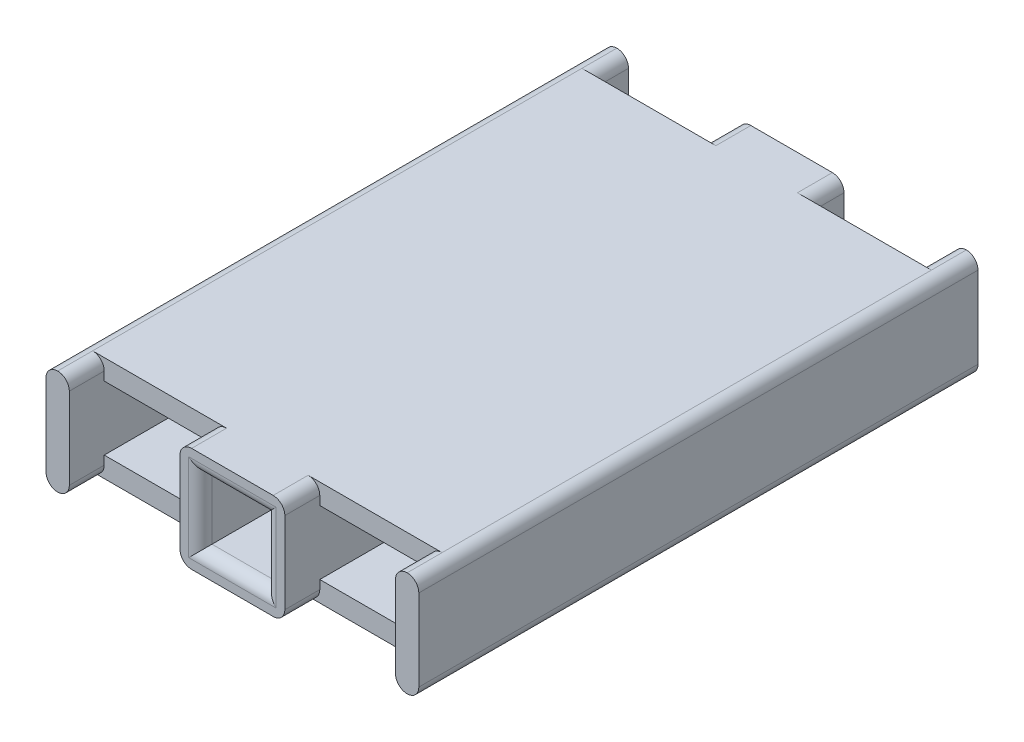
ISO-10303-21;
HEADER;
FILE_DESCRIPTION(('STEP AP214'),'2;1');
FILE_NAME('part.step','',(''),(''),'','','');
FILE_SCHEMA(('AUTOMOTIVE_DESIGN { 1 0 10303 214 1 1 1 1 }'));
ENDSEC;
DATA;
#1=APPLICATION_CONTEXT('core data for automotive mechanical design processes');
#2=APPLICATION_PROTOCOL_DEFINITION('international standard','automotive_design',2000,#1);
#3=PRODUCT_CONTEXT('',#1,'mechanical');
#4=PRODUCT('Part','Part','',(#3));
#5=PRODUCT_RELATED_PRODUCT_CATEGORY('part','',(#4));
#6=PRODUCT_DEFINITION_FORMATION('','',#4);
#7=PRODUCT_DEFINITION_CONTEXT('part definition',#1,'design');
#8=PRODUCT_DEFINITION('design','',#6,#7);
#9=PRODUCT_DEFINITION_SHAPE('','',#8);
#10=(LENGTH_UNIT() NAMED_UNIT(*) SI_UNIT(.MILLI.,.METRE.));
#11=(NAMED_UNIT(*) PLANE_ANGLE_UNIT() SI_UNIT($,.RADIAN.));
#12=(NAMED_UNIT(*) SI_UNIT($,.STERADIAN.) SOLID_ANGLE_UNIT());
#13=UNCERTAINTY_MEASURE_WITH_UNIT(LENGTH_MEASURE(1.E-05),#10,'distance_accuracy_value','');
#14=(GEOMETRIC_REPRESENTATION_CONTEXT(3) GLOBAL_UNCERTAINTY_ASSIGNED_CONTEXT((#13)) GLOBAL_UNIT_ASSIGNED_CONTEXT((#10,
#11,#12)) REPRESENTATION_CONTEXT('',''));
#15=CARTESIAN_POINT('',(0.,0.,0.));
#16=DIRECTION('',(0.,0.,1.));
#17=DIRECTION('',(1.,0.,0.));
#18=AXIS2_PLACEMENT_3D('',#15,#16,#17);
#19=CARTESIAN_POINT('',(0.,0.,21.));
#20=DIRECTION('',(0.,0.,1.));
#21=DIRECTION('',(1.,0.,0.));
#22=AXIS2_PLACEMENT_3D('',#19,#20,#21);
#23=PLANE('',#22);
#24=DIRECTION('',(0.,-1.,0.));
#25=VECTOR('',#24,1.);
#26=CARTESIAN_POINT('',(14.,0.,21.));
#27=LINE('',#26,#25);
#28=CARTESIAN_POINT('',(14.,3.5,21.));
#29=VERTEX_POINT('',#28);
#30=CARTESIAN_POINT('',(14.,2.75,21.));
#31=VERTEX_POINT('',#30);
#32=EDGE_CURVE('E382',#29,#31,#27,.T.);
#33=ORIENTED_EDGE('',*,*,#32,.F.);
#34=CARTESIAN_POINT('',(15.,3.5,21.));
#35=DIRECTION('',(0.,0.,1.));
#36=DIRECTION('',(1.,0.,0.));
#37=AXIS2_PLACEMENT_3D('',#34,#35,#36);
#38=CIRCLE('',#37,1.);
#39=CARTESIAN_POINT('',(15.,4.5,21.));
#40=VERTEX_POINT('',#39);
#41=EDGE_CURVE('E608',#29,#40,#38,.F.);
#42=ORIENTED_EDGE('',*,*,#41,.T.);
#43=DIRECTION('',(1.,0.,0.));
#44=VECTOR('',#43,1.);
#45=CARTESIAN_POINT('',(0.,4.5,21.));
#46=LINE('',#45,#44);
#47=CARTESIAN_POINT('',(3.5,4.5,21.));
#48=VERTEX_POINT('',#47);
#49=EDGE_CURVE('E428',#48,#40,#46,.T.);
#50=ORIENTED_EDGE('',*,*,#49,.F.);
#51=CARTESIAN_POINT('',(3.5,3.5,21.));
#52=DIRECTION('',(0.,0.,1.));
#53=DIRECTION('',(1.,0.,0.));
#54=AXIS2_PLACEMENT_3D('',#51,#52,#53);
#55=CIRCLE('',#54,1.);
#56=CARTESIAN_POINT('',(4.5,3.5,21.));
#57=VERTEX_POINT('',#56);
#58=EDGE_CURVE('E612',#48,#57,#55,.F.);
#59=ORIENTED_EDGE('',*,*,#58,.T.);
#60=DIRECTION('',(0.,-1.,0.));
#61=VECTOR('',#60,1.);
#62=CARTESIAN_POINT('',(4.5,0.,21.));
#63=LINE('',#62,#61);
#64=CARTESIAN_POINT('',(4.5,2.75,21.));
#65=VERTEX_POINT('',#64);
#66=EDGE_CURVE('E871',#57,#65,#63,.T.);
#67=ORIENTED_EDGE('',*,*,#66,.T.);
#68=DIRECTION('',(1.,0.,0.));
#69=VECTOR('',#68,1.);
#70=CARTESIAN_POINT('',(0.,2.75,21.));
#71=LINE('',#70,#69);
#72=EDGE_CURVE('E398',#65,#31,#71,.T.);
#73=ORIENTED_EDGE('',*,*,#72,.T.);
#74=EDGE_LOOP('',(#33,#42,#50,#59,#67,#73));
#75=FACE_BOUND('',#74,.T.);
#76=ADVANCED_FACE('F37',(#75),#23,.T.);
#77=CARTESIAN_POINT('',(0.,0.,-21.));
#78=DIRECTION('',(0.,0.,1.));
#79=DIRECTION('',(1.,0.,0.));
#80=AXIS2_PLACEMENT_3D('',#77,#78,#79);
#81=PLANE('',#80);
#82=DIRECTION('',(1.,0.,0.));
#83=VECTOR('',#82,1.);
#84=CARTESIAN_POINT('',(0.,4.5,-21.));
#85=LINE('',#84,#83);
#86=CARTESIAN_POINT('',(3.5,4.5,-21.));
#87=VERTEX_POINT('',#86);
#88=CARTESIAN_POINT('',(15.,4.5,-21.));
#89=VERTEX_POINT('',#88);
#90=EDGE_CURVE('E414',#87,#89,#85,.T.);
#91=ORIENTED_EDGE('',*,*,#90,.T.);
#92=CARTESIAN_POINT('',(15.,3.5,-21.));
#93=DIRECTION('',(0.,0.,1.));
#94=DIRECTION('',(1.,0.,0.));
#95=AXIS2_PLACEMENT_3D('',#92,#93,#94);
#96=CIRCLE('',#95,1.);
#97=CARTESIAN_POINT('',(14.,3.5,-21.));
#98=VERTEX_POINT('',#97);
#99=EDGE_CURVE('E603',#89,#98,#96,.T.);
#100=ORIENTED_EDGE('',*,*,#99,.T.);
#101=DIRECTION('',(0.,-1.,0.));
#102=VECTOR('',#101,1.);
#103=CARTESIAN_POINT('',(14.,0.,-21.));
#104=LINE('',#103,#102);
#105=CARTESIAN_POINT('',(14.,2.75,-21.));
#106=VERTEX_POINT('',#105);
#107=EDGE_CURVE('E379',#98,#106,#104,.T.);
#108=ORIENTED_EDGE('',*,*,#107,.T.);
#109=DIRECTION('',(1.,0.,0.));
#110=VECTOR('',#109,1.);
#111=CARTESIAN_POINT('',(0.,2.75,-21.));
#112=LINE('',#111,#110);
#113=CARTESIAN_POINT('',(4.5,2.75,-21.));
#114=VERTEX_POINT('',#113);
#115=EDGE_CURVE('E417',#114,#106,#112,.T.);
#116=ORIENTED_EDGE('',*,*,#115,.F.);
#117=DIRECTION('',(0.,-1.,0.));
#118=VECTOR('',#117,1.);
#119=CARTESIAN_POINT('',(4.5,0.,-21.));
#120=LINE('',#119,#118);
#121=CARTESIAN_POINT('',(4.5,3.5,-21.));
#122=VERTEX_POINT('',#121);
#123=EDGE_CURVE('E804',#122,#114,#120,.T.);
#124=ORIENTED_EDGE('',*,*,#123,.F.);
#125=CARTESIAN_POINT('',(3.5,3.5,-21.));
#126=DIRECTION('',(0.,0.,1.));
#127=DIRECTION('',(1.,0.,0.));
#128=AXIS2_PLACEMENT_3D('',#125,#126,#127);
#129=CIRCLE('',#128,1.);
#130=EDGE_CURVE('E598',#122,#87,#129,.T.);
#131=ORIENTED_EDGE('',*,*,#130,.T.);
#132=EDGE_LOOP('',(#91,#100,#108,#116,#124,#131));
#133=FACE_BOUND('',#132,.T.);
#134=ADVANCED_FACE('F760',(#133),#81,.F.);
#135=CARTESIAN_POINT('',(14.,-2.75,21.));
#136=VERTEX_POINT('',#135);
#137=CARTESIAN_POINT('',(14.,-3.5,21.));
#138=VERTEX_POINT('',#137);
#139=EDGE_CURVE('E368',#136,#138,#27,.T.);
#140=ORIENTED_EDGE('',*,*,#139,.F.);
#141=DIRECTION('',(1.,0.,0.));
#142=VECTOR('',#141,1.);
#143=CARTESIAN_POINT('',(0.,-2.75,21.));
#144=LINE('',#143,#142);
#145=CARTESIAN_POINT('',(4.5,-2.75,21.));
#146=VERTEX_POINT('',#145);
#147=EDGE_CURVE('E373',#146,#136,#144,.T.);
#148=ORIENTED_EDGE('',*,*,#147,.F.);
#149=CARTESIAN_POINT('',(4.5,-3.5,21.));
#150=VERTEX_POINT('',#149);
#151=EDGE_CURVE('E802',#146,#150,#63,.T.);
#152=ORIENTED_EDGE('',*,*,#151,.T.);
#153=CARTESIAN_POINT('',(3.5,-3.5,21.));
#154=DIRECTION('',(0.,0.,1.));
#155=DIRECTION('',(1.,0.,0.));
#156=AXIS2_PLACEMENT_3D('',#153,#154,#155);
#157=CIRCLE('',#156,1.);
#158=CARTESIAN_POINT('',(3.5,-4.5,21.));
#159=VERTEX_POINT('',#158);
#160=EDGE_CURVE('E614',#150,#159,#157,.F.);
#161=ORIENTED_EDGE('',*,*,#160,.T.);
#162=DIRECTION('',(1.,0.,0.));
#163=VECTOR('',#162,1.);
#164=CARTESIAN_POINT('',(0.,-4.5,21.));
#165=LINE('',#164,#163);
#166=CARTESIAN_POINT('',(15.,-4.5,21.));
#167=VERTEX_POINT('',#166);
#168=EDGE_CURVE('E894',#159,#167,#165,.T.);
#169=ORIENTED_EDGE('',*,*,#168,.T.);
#170=CARTESIAN_POINT('',(15.,-3.5,21.));
#171=DIRECTION('',(0.,0.,1.));
#172=DIRECTION('',(1.,0.,0.));
#173=AXIS2_PLACEMENT_3D('',#170,#171,#172);
#174=CIRCLE('',#173,1.);
#175=EDGE_CURVE('E376',#167,#138,#174,.F.);
#176=ORIENTED_EDGE('',*,*,#175,.T.);
#177=EDGE_LOOP('',(#140,#148,#152,#161,#169,#176));
#178=FACE_BOUND('',#177,.T.);
#179=ADVANCED_FACE('F370',(#178),#23,.T.);
#180=DIRECTION('',(0.,-1.,0.));
#181=VECTOR('',#180,1.);
#182=CARTESIAN_POINT('',(-4.5,0.,21.));
#183=LINE('',#182,#181);
#184=CARTESIAN_POINT('',(-4.5,3.5,21.));
#185=VERTEX_POINT('',#184);
#186=CARTESIAN_POINT('',(-4.5,2.75,21.));
#187=VERTEX_POINT('',#186);
#188=EDGE_CURVE('E792',#185,#187,#183,.T.);
#189=ORIENTED_EDGE('',*,*,#188,.F.);
#190=CARTESIAN_POINT('',(-3.5,3.5,21.));
#191=DIRECTION('',(0.,0.,1.));
#192=DIRECTION('',(1.,0.,0.));
#193=AXIS2_PLACEMENT_3D('',#190,#191,#192);
#194=CIRCLE('',#193,1.);
#195=CARTESIAN_POINT('',(-3.5,4.5,21.));
#196=VERTEX_POINT('',#195);
#197=EDGE_CURVE('E617',#185,#196,#194,.F.);
#198=ORIENTED_EDGE('',*,*,#197,.T.);
#199=CARTESIAN_POINT('',(-15.,4.5,21.));
#200=VERTEX_POINT('',#199);
#201=EDGE_CURVE('E893',#200,#196,#46,.T.);
#202=ORIENTED_EDGE('',*,*,#201,.F.);
#203=CARTESIAN_POINT('',(-15.,3.5,21.));
#204=DIRECTION('',(0.,0.,1.));
#205=DIRECTION('',(1.,0.,0.));
#206=AXIS2_PLACEMENT_3D('',#203,#204,#205);
#207=CIRCLE('',#206,1.);
#208=CARTESIAN_POINT('',(-14.,3.5,21.));
#209=VERTEX_POINT('',#208);
#210=EDGE_CURVE('E625',#200,#209,#207,.F.);
#211=ORIENTED_EDGE('',*,*,#210,.T.);
#212=DIRECTION('',(0.,-1.,0.));
#213=VECTOR('',#212,1.);
#214=CARTESIAN_POINT('',(-14.,0.,21.));
#215=LINE('',#214,#213);
#216=CARTESIAN_POINT('',(-14.,2.75,21.));
#217=VERTEX_POINT('',#216);
#218=EDGE_CURVE('E892',#209,#217,#215,.T.);
#219=ORIENTED_EDGE('',*,*,#218,.T.);
#220=DIRECTION('',(1.,0.,0.));
#221=VECTOR('',#220,1.);
#222=CARTESIAN_POINT('',(0.,2.75,21.));
#223=LINE('',#222,#221);
#224=EDGE_CURVE('E397',#217,#187,#223,.T.);
#225=ORIENTED_EDGE('',*,*,#224,.T.);
#226=EDGE_LOOP('',(#189,#198,#202,#211,#219,#225));
#227=FACE_BOUND('',#226,.T.);
#228=ADVANCED_FACE('F774',(#227),#23,.T.);
#229=DIRECTION('',(1.,0.,0.));
#230=VECTOR('',#229,1.);
#231=CARTESIAN_POINT('',(0.,-2.75,-21.));
#232=LINE('',#231,#230);
#233=CARTESIAN_POINT('',(4.5,-2.75,-21.));
#234=VERTEX_POINT('',#233);
#235=CARTESIAN_POINT('',(14.,-2.75,-21.));
#236=VERTEX_POINT('',#235);
#237=EDGE_CURVE('E420',#234,#236,#232,.T.);
#238=ORIENTED_EDGE('',*,*,#237,.T.);
#239=CARTESIAN_POINT('',(14.,-3.5,-21.));
#240=VERTEX_POINT('',#239);
#241=EDGE_CURVE('E380',#236,#240,#104,.T.);
#242=ORIENTED_EDGE('',*,*,#241,.T.);
#243=CARTESIAN_POINT('',(15.,-3.5,-21.));
#244=DIRECTION('',(0.,0.,1.));
#245=DIRECTION('',(1.,0.,0.));
#246=AXIS2_PLACEMENT_3D('',#243,#244,#245);
#247=CIRCLE('',#246,1.);
#248=CARTESIAN_POINT('',(15.,-4.5,-21.));
#249=VERTEX_POINT('',#248);
#250=EDGE_CURVE('E605',#240,#249,#247,.T.);
#251=ORIENTED_EDGE('',*,*,#250,.T.);
#252=DIRECTION('',(1.,0.,0.));
#253=VECTOR('',#252,1.);
#254=CARTESIAN_POINT('',(0.,-4.5,-21.));
#255=LINE('',#254,#253);
#256=CARTESIAN_POINT('',(3.5,-4.5,-21.));
#257=VERTEX_POINT('',#256);
#258=EDGE_CURVE('E413',#257,#249,#255,.T.);
#259=ORIENTED_EDGE('',*,*,#258,.F.);
#260=CARTESIAN_POINT('',(3.5,-3.5,-21.));
#261=DIRECTION('',(0.,0.,1.));
#262=DIRECTION('',(1.,0.,0.));
#263=AXIS2_PLACEMENT_3D('',#260,#261,#262);
#264=CIRCLE('',#263,1.);
#265=CARTESIAN_POINT('',(4.5,-3.5,-21.));
#266=VERTEX_POINT('',#265);
#267=EDGE_CURVE('E601',#257,#266,#264,.T.);
#268=ORIENTED_EDGE('',*,*,#267,.T.);
#269=EDGE_CURVE('E797',#234,#266,#120,.T.);
#270=ORIENTED_EDGE('',*,*,#269,.F.);
#271=EDGE_LOOP('',(#238,#242,#251,#259,#268,#270));
#272=FACE_BOUND('',#271,.T.);
#273=ADVANCED_FACE('F769',(#272),#81,.F.);
#274=CARTESIAN_POINT('',(-15.,4.5,-21.));
#275=VERTEX_POINT('',#274);
#276=CARTESIAN_POINT('',(-3.5,4.5,-21.));
#277=VERTEX_POINT('',#276);
#278=EDGE_CURVE('E411',#275,#277,#85,.T.);
#279=ORIENTED_EDGE('',*,*,#278,.T.);
#280=CARTESIAN_POINT('',(-3.5,3.5,-21.));
#281=DIRECTION('',(0.,0.,1.));
#282=DIRECTION('',(1.,0.,0.));
#283=AXIS2_PLACEMENT_3D('',#280,#281,#282);
#284=CIRCLE('',#283,1.);
#285=CARTESIAN_POINT('',(-4.5,3.5,-21.));
#286=VERTEX_POINT('',#285);
#287=EDGE_CURVE('E593',#277,#286,#284,.T.);
#288=ORIENTED_EDGE('',*,*,#287,.T.);
#289=DIRECTION('',(0.,-1.,0.));
#290=VECTOR('',#289,1.);
#291=CARTESIAN_POINT('',(-4.5,0.,-21.));
#292=LINE('',#291,#290);
#293=CARTESIAN_POINT('',(-4.5,2.75,-21.));
#294=VERTEX_POINT('',#293);
#295=EDGE_CURVE('E798',#286,#294,#292,.T.);
#296=ORIENTED_EDGE('',*,*,#295,.T.);
#297=DIRECTION('',(1.,0.,0.));
#298=VECTOR('',#297,1.);
#299=CARTESIAN_POINT('',(0.,2.75,-21.));
#300=LINE('',#299,#298);
#301=CARTESIAN_POINT('',(-14.,2.75,-21.));
#302=VERTEX_POINT('',#301);
#303=EDGE_CURVE('E422',#302,#294,#300,.T.);
#304=ORIENTED_EDGE('',*,*,#303,.F.);
#305=DIRECTION('',(0.,-1.,0.));
#306=VECTOR('',#305,1.);
#307=CARTESIAN_POINT('',(-14.,0.,-21.));
#308=LINE('',#307,#306);
#309=CARTESIAN_POINT('',(-14.,3.5,-21.));
#310=VERTEX_POINT('',#309);
#311=EDGE_CURVE('E458',#310,#302,#308,.T.);
#312=ORIENTED_EDGE('',*,*,#311,.F.);
#313=CARTESIAN_POINT('',(-15.,3.5,-21.));
#314=DIRECTION('',(0.,0.,1.));
#315=DIRECTION('',(1.,0.,0.));
#316=AXIS2_PLACEMENT_3D('',#313,#314,#315);
#317=CIRCLE('',#316,1.);
#318=EDGE_CURVE('E588',#310,#275,#317,.T.);
#319=ORIENTED_EDGE('',*,*,#318,.T.);
#320=EDGE_LOOP('',(#279,#288,#296,#304,#312,#319));
#321=FACE_BOUND('',#320,.T.);
#322=ADVANCED_FACE('F776',(#321),#81,.F.);
#323=CARTESIAN_POINT('',(-4.5,-2.75,21.));
#324=VERTEX_POINT('',#323);
#325=CARTESIAN_POINT('',(-4.5,-3.5,21.));
#326=VERTEX_POINT('',#325);
#327=EDGE_CURVE('E800',#324,#326,#183,.T.);
#328=ORIENTED_EDGE('',*,*,#327,.F.);
#329=DIRECTION('',(1.,0.,0.));
#330=VECTOR('',#329,1.);
#331=CARTESIAN_POINT('',(0.,-2.75,21.));
#332=LINE('',#331,#330);
#333=CARTESIAN_POINT('',(-14.,-2.75,21.));
#334=VERTEX_POINT('',#333);
#335=EDGE_CURVE('E401',#334,#324,#332,.T.);
#336=ORIENTED_EDGE('',*,*,#335,.F.);
#337=CARTESIAN_POINT('',(-14.,-3.5,21.));
#338=VERTEX_POINT('',#337);
#339=EDGE_CURVE('E885',#334,#338,#215,.T.);
#340=ORIENTED_EDGE('',*,*,#339,.T.);
#341=CARTESIAN_POINT('',(-15.,-3.5,21.));
#342=DIRECTION('',(0.,0.,1.));
#343=DIRECTION('',(1.,0.,0.));
#344=AXIS2_PLACEMENT_3D('',#341,#342,#343);
#345=CIRCLE('',#344,1.);
#346=CARTESIAN_POINT('',(-15.,-4.5,21.));
#347=VERTEX_POINT('',#346);
#348=EDGE_CURVE('E622',#338,#347,#345,.F.);
#349=ORIENTED_EDGE('',*,*,#348,.T.);
#350=CARTESIAN_POINT('',(-3.5,-4.5,21.));
#351=VERTEX_POINT('',#350);
#352=EDGE_CURVE('E404',#347,#351,#165,.T.);
#353=ORIENTED_EDGE('',*,*,#352,.T.);
#354=CARTESIAN_POINT('',(-3.5,-3.5,21.));
#355=DIRECTION('',(0.,0.,1.));
#356=DIRECTION('',(1.,0.,0.));
#357=AXIS2_PLACEMENT_3D('',#354,#355,#356);
#358=CIRCLE('',#357,1.);
#359=EDGE_CURVE('E620',#351,#326,#358,.F.);
#360=ORIENTED_EDGE('',*,*,#359,.T.);
#361=EDGE_LOOP('',(#328,#336,#340,#349,#353,#360));
#362=FACE_BOUND('',#361,.T.);
#363=ADVANCED_FACE('F763',(#362),#23,.T.);
#364=DIRECTION('',(1.,0.,0.));
#365=VECTOR('',#364,1.);
#366=CARTESIAN_POINT('',(0.,-2.75,-21.));
#367=LINE('',#366,#365);
#368=CARTESIAN_POINT('',(-14.,-2.75,-21.));
#369=VERTEX_POINT('',#368);
#370=CARTESIAN_POINT('',(-4.5,-2.75,-21.));
#371=VERTEX_POINT('',#370);
#372=EDGE_CURVE('E425',#369,#371,#367,.T.);
#373=ORIENTED_EDGE('',*,*,#372,.T.);
#374=CARTESIAN_POINT('',(-4.5,-3.5,-21.));
#375=VERTEX_POINT('',#374);
#376=EDGE_CURVE('E806',#371,#375,#292,.T.);
#377=ORIENTED_EDGE('',*,*,#376,.T.);
#378=CARTESIAN_POINT('',(-3.5,-3.5,-21.));
#379=DIRECTION('',(0.,0.,1.));
#380=DIRECTION('',(1.,0.,0.));
#381=AXIS2_PLACEMENT_3D('',#378,#379,#380);
#382=CIRCLE('',#381,1.);
#383=CARTESIAN_POINT('',(-3.5,-4.5,-21.));
#384=VERTEX_POINT('',#383);
#385=EDGE_CURVE('E595',#375,#384,#382,.T.);
#386=ORIENTED_EDGE('',*,*,#385,.T.);
#387=CARTESIAN_POINT('',(-15.,-4.5,-21.));
#388=VERTEX_POINT('',#387);
#389=EDGE_CURVE('E415',#388,#384,#255,.T.);
#390=ORIENTED_EDGE('',*,*,#389,.F.);
#391=CARTESIAN_POINT('',(-15.,-3.5,-21.));
#392=DIRECTION('',(0.,0.,1.));
#393=DIRECTION('',(1.,0.,0.));
#394=AXIS2_PLACEMENT_3D('',#391,#392,#393);
#395=CIRCLE('',#394,1.);
#396=CARTESIAN_POINT('',(-14.,-3.5,-21.));
#397=VERTEX_POINT('',#396);
#398=EDGE_CURVE('E591',#388,#397,#395,.T.);
#399=ORIENTED_EDGE('',*,*,#398,.T.);
#400=EDGE_CURVE('E439',#369,#397,#308,.T.);
#401=ORIENTED_EDGE('',*,*,#400,.F.);
#402=EDGE_LOOP('',(#373,#377,#386,#390,#399,#401));
#403=FACE_BOUND('',#402,.T.);
#404=ADVANCED_FACE('F770',(#403),#81,.F.);
#405=CARTESIAN_POINT('',(0.,2.75,21.));
#406=DIRECTION('',(0.,1.,0.));
#407=DIRECTION('',(0.,0.,1.));
#408=AXIS2_PLACEMENT_3D('',#405,#406,#407);
#409=PLANE('',#408);
#410=ORIENTED_EDGE('',*,*,#303,.T.);
#411=DIRECTION('',(0.,0.,-1.));
#412=VECTOR('',#411,1.);
#413=CARTESIAN_POINT('',(-4.5,2.75,21.));
#414=LINE('',#413,#412);
#415=EDGE_CURVE('E432',#187,#294,#414,.T.);
#416=ORIENTED_EDGE('',*,*,#415,.F.);
#417=ORIENTED_EDGE('',*,*,#224,.F.);
#418=DIRECTION('',(0.,0.,-1.));
#419=VECTOR('',#418,1.);
#420=CARTESIAN_POINT('',(-14.,2.75,21.));
#421=LINE('',#420,#419);
#422=EDGE_CURVE('E440',#217,#302,#421,.T.);
#423=ORIENTED_EDGE('',*,*,#422,.T.);
#424=EDGE_LOOP('',(#410,#416,#417,#423));
#425=FACE_BOUND('',#424,.T.);
#426=ADVANCED_FACE('F782',(#425),#409,.F.);
#427=CARTESIAN_POINT('',(-4.5,0.,21.));
#428=DIRECTION('',(-1.,0.,0.));
#429=DIRECTION('',(0.,0.,1.));
#430=AXIS2_PLACEMENT_3D('',#427,#428,#429);
#431=PLANE('',#430);
#432=ORIENTED_EDGE('',*,*,#295,.F.);
#433=DIRECTION('',(0.,0.,-1.));
#434=VECTOR('',#433,1.);
#435=CARTESIAN_POINT('',(-4.5,3.5,21.));
#436=LINE('',#435,#434);
#437=CARTESIAN_POINT('',(-4.5,3.5,-24.));
#438=VERTEX_POINT('',#437);
#439=EDGE_CURVE('E518',#286,#438,#436,.T.);
#440=ORIENTED_EDGE('',*,*,#439,.T.);
#441=DIRECTION('',(0.,1.,0.));
#442=VECTOR('',#441,1.);
#443=CARTESIAN_POINT('',(-4.5,0.,-24.));
#444=LINE('',#443,#442);
#445=CARTESIAN_POINT('',(-4.5,-3.5,-24.));
#446=VERTEX_POINT('',#445);
#447=EDGE_CURVE('E817',#446,#438,#444,.T.);
#448=ORIENTED_EDGE('',*,*,#447,.F.);
#449=DIRECTION('',(0.,0.,-1.));
#450=VECTOR('',#449,1.);
#451=CARTESIAN_POINT('',(-4.5,-3.5,-21.));
#452=LINE('',#451,#450);
#453=EDGE_CURVE('E516',#446,#375,#452,.F.);
#454=ORIENTED_EDGE('',*,*,#453,.T.);
#455=ORIENTED_EDGE('',*,*,#376,.F.);
#456=DIRECTION('',(0.,0.,-1.));
#457=VECTOR('',#456,1.);
#458=CARTESIAN_POINT('',(-4.5,-2.75,21.));
#459=LINE('',#458,#457);
#460=EDGE_CURVE('E446',#324,#371,#459,.T.);
#461=ORIENTED_EDGE('',*,*,#460,.F.);
#462=ORIENTED_EDGE('',*,*,#327,.T.);
#463=DIRECTION('',(0.,0.,-1.));
#464=VECTOR('',#463,1.);
#465=CARTESIAN_POINT('',(-4.5,-3.5,24.));
#466=LINE('',#465,#464);
#467=CARTESIAN_POINT('',(-4.5,-3.5,24.));
#468=VERTEX_POINT('',#467);
#469=EDGE_CURVE('E511',#326,#468,#466,.F.);
#470=ORIENTED_EDGE('',*,*,#469,.T.);
#471=DIRECTION('',(0.,1.,0.));
#472=VECTOR('',#471,1.);
#473=CARTESIAN_POINT('',(-4.5,0.,24.));
#474=LINE('',#473,#472);
#475=CARTESIAN_POINT('',(-4.5,3.5,24.));
#476=VERTEX_POINT('',#475);
#477=EDGE_CURVE('E811',#468,#476,#474,.T.);
#478=ORIENTED_EDGE('',*,*,#477,.T.);
#479=DIRECTION('',(0.,0.,-1.));
#480=VECTOR('',#479,1.);
#481=CARTESIAN_POINT('',(-4.5,3.5,21.));
#482=LINE('',#481,#480);
#483=EDGE_CURVE('E513',#476,#185,#482,.T.);
#484=ORIENTED_EDGE('',*,*,#483,.T.);
#485=ORIENTED_EDGE('',*,*,#188,.T.);
#486=ORIENTED_EDGE('',*,*,#415,.T.);
#487=EDGE_LOOP('',(#432,#440,#448,#454,#455,#461,#462,#470,#478,#484,#485,#486));
#488=FACE_BOUND('',#487,.T.);
#489=ADVANCED_FACE('F951',(#488),#431,.T.);
#490=CARTESIAN_POINT('',(0.,-2.75,21.));
#491=DIRECTION('',(0.,1.,0.));
#492=DIRECTION('',(0.,0.,1.));
#493=AXIS2_PLACEMENT_3D('',#490,#491,#492);
#494=PLANE('',#493);
#495=ORIENTED_EDGE('',*,*,#372,.F.);
#496=DIRECTION('',(0.,0.,-1.));
#497=VECTOR('',#496,1.);
#498=CARTESIAN_POINT('',(-14.,-2.75,21.));
#499=LINE('',#498,#497);
#500=EDGE_CURVE('E443',#334,#369,#499,.T.);
#501=ORIENTED_EDGE('',*,*,#500,.F.);
#502=ORIENTED_EDGE('',*,*,#335,.T.);
#503=ORIENTED_EDGE('',*,*,#460,.T.);
#504=EDGE_LOOP('',(#495,#501,#502,#503));
#505=FACE_BOUND('',#504,.T.);
#506=ADVANCED_FACE('F1000',(#505),#494,.T.);
#507=CARTESIAN_POINT('',(0.,2.75,21.));
#508=DIRECTION('',(0.,1.,0.));
#509=DIRECTION('',(0.,0.,1.));
#510=AXIS2_PLACEMENT_3D('',#507,#508,#509);
#511=PLANE('',#510);
#512=ORIENTED_EDGE('',*,*,#115,.T.);
#513=DIRECTION('',(0.,0.,-1.));
#514=VECTOR('',#513,1.);
#515=CARTESIAN_POINT('',(14.,2.75,21.));
#516=LINE('',#515,#514);
#517=EDGE_CURVE('E392',#31,#106,#516,.T.);
#518=ORIENTED_EDGE('',*,*,#517,.F.);
#519=ORIENTED_EDGE('',*,*,#72,.F.);
#520=DIRECTION('',(0.,0.,-1.));
#521=VECTOR('',#520,1.);
#522=CARTESIAN_POINT('',(4.5,2.75,21.));
#523=LINE('',#522,#521);
#524=EDGE_CURVE('E410',#65,#114,#523,.T.);
#525=ORIENTED_EDGE('',*,*,#524,.T.);
#526=EDGE_LOOP('',(#512,#518,#519,#525));
#527=FACE_BOUND('',#526,.T.);
#528=ADVANCED_FACE('F866',(#527),#511,.F.);
#529=CARTESIAN_POINT('',(14.,0.,21.));
#530=DIRECTION('',(-1.,0.,0.));
#531=DIRECTION('',(0.,0.,1.));
#532=AXIS2_PLACEMENT_3D('',#529,#530,#531);
#533=PLANE('',#532);
#534=ORIENTED_EDGE('',*,*,#107,.F.);
#535=DIRECTION('',(0.,0.,-1.));
#536=VECTOR('',#535,1.);
#537=CARTESIAN_POINT('',(14.,3.5,21.));
#538=LINE('',#537,#536);
#539=CARTESIAN_POINT('',(14.,3.5,-24.));
#540=VERTEX_POINT('',#539);
#541=EDGE_CURVE('E545',#98,#540,#538,.T.);
#542=ORIENTED_EDGE('',*,*,#541,.T.);
#543=DIRECTION('',(0.,1.,0.));
#544=VECTOR('',#543,1.);
#545=CARTESIAN_POINT('',(14.,0.,-24.));
#546=LINE('',#545,#544);
#547=CARTESIAN_POINT('',(14.,-3.5,-24.));
#548=VERTEX_POINT('',#547);
#549=EDGE_CURVE('E635',#548,#540,#546,.T.);
#550=ORIENTED_EDGE('',*,*,#549,.F.);
#551=DIRECTION('',(0.,0.,-1.));
#552=VECTOR('',#551,1.);
#553=CARTESIAN_POINT('',(14.,-3.5,-21.));
#554=LINE('',#553,#552);
#555=EDGE_CURVE('E543',#548,#240,#554,.F.);
#556=ORIENTED_EDGE('',*,*,#555,.T.);
#557=ORIENTED_EDGE('',*,*,#241,.F.);
#558=DIRECTION('',(0.,0.,-1.));
#559=VECTOR('',#558,1.);
#560=CARTESIAN_POINT('',(14.,-2.75,21.));
#561=LINE('',#560,#559);
#562=EDGE_CURVE('E384',#136,#236,#561,.T.);
#563=ORIENTED_EDGE('',*,*,#562,.F.);
#564=ORIENTED_EDGE('',*,*,#139,.T.);
#565=DIRECTION('',(0.,0.,-1.));
#566=VECTOR('',#565,1.);
#567=CARTESIAN_POINT('',(14.,-3.5,24.));
#568=LINE('',#567,#566);
#569=CARTESIAN_POINT('',(14.,-3.5,24.));
#570=VERTEX_POINT('',#569);
#571=EDGE_CURVE('E539',#138,#570,#568,.F.);
#572=ORIENTED_EDGE('',*,*,#571,.T.);
#573=DIRECTION('',(0.,1.,0.));
#574=VECTOR('',#573,1.);
#575=CARTESIAN_POINT('',(14.,0.,24.));
#576=LINE('',#575,#574);
#577=CARTESIAN_POINT('',(14.,3.5,24.));
#578=VERTEX_POINT('',#577);
#579=EDGE_CURVE('E842',#570,#578,#576,.T.);
#580=ORIENTED_EDGE('',*,*,#579,.T.);
#581=DIRECTION('',(0.,0.,-1.));
#582=VECTOR('',#581,1.);
#583=CARTESIAN_POINT('',(14.,3.5,21.));
#584=LINE('',#583,#582);
#585=EDGE_CURVE('E541',#578,#29,#584,.T.);
#586=ORIENTED_EDGE('',*,*,#585,.T.);
#587=ORIENTED_EDGE('',*,*,#32,.T.);
#588=ORIENTED_EDGE('',*,*,#517,.T.);
#589=EDGE_LOOP('',(#534,#542,#550,#556,#557,#563,#564,#572,#580,#586,#587,#588));
#590=FACE_BOUND('',#589,.T.);
#591=ADVANCED_FACE('F386',(#590),#533,.T.);
#592=CARTESIAN_POINT('',(0.,-2.75,21.));
#593=DIRECTION('',(0.,1.,0.));
#594=DIRECTION('',(0.,0.,1.));
#595=AXIS2_PLACEMENT_3D('',#592,#593,#594);
#596=PLANE('',#595);
#597=ORIENTED_EDGE('',*,*,#237,.F.);
#598=DIRECTION('',(0.,0.,-1.));
#599=VECTOR('',#598,1.);
#600=CARTESIAN_POINT('',(4.5,-2.75,21.));
#601=LINE('',#600,#599);
#602=EDGE_CURVE('E393',#146,#234,#601,.T.);
#603=ORIENTED_EDGE('',*,*,#602,.F.);
#604=ORIENTED_EDGE('',*,*,#147,.T.);
#605=ORIENTED_EDGE('',*,*,#562,.T.);
#606=EDGE_LOOP('',(#597,#603,#604,#605));
#607=FACE_BOUND('',#606,.T.);
#608=ADVANCED_FACE('F395',(#607),#596,.T.);
#609=CARTESIAN_POINT('',(16.,0.,21.));
#610=DIRECTION('',(1.,0.,0.));
#611=DIRECTION('',(0.,1.,0.));
#612=AXIS2_PLACEMENT_3D('',#609,#610,#611);
#613=PLANE('',#612);
#614=DIRECTION('',(0.,-1.,0.));
#615=VECTOR('',#614,1.);
#616=CARTESIAN_POINT('',(16.,0.,-24.));
#617=LINE('',#616,#615);
#618=CARTESIAN_POINT('',(16.,3.5,-24.));
#619=VERTEX_POINT('',#618);
#620=CARTESIAN_POINT('',(16.,-3.5,-24.));
#621=VERTEX_POINT('',#620);
#622=EDGE_CURVE('E839',#619,#621,#617,.T.);
#623=ORIENTED_EDGE('',*,*,#622,.F.);
#624=DIRECTION('',(0.,0.,-1.));
#625=VECTOR('',#624,1.);
#626=CARTESIAN_POINT('',(16.,3.5,21.));
#627=LINE('',#626,#625);
#628=CARTESIAN_POINT('',(16.,3.5,24.));
#629=VERTEX_POINT('',#628);
#630=EDGE_CURVE('E586',#619,#629,#627,.F.);
#631=ORIENTED_EDGE('',*,*,#630,.T.);
#632=DIRECTION('',(0.,-1.,0.));
#633=VECTOR('',#632,1.);
#634=CARTESIAN_POINT('',(16.,0.,24.));
#635=LINE('',#634,#633);
#636=CARTESIAN_POINT('',(16.,-3.5,24.));
#637=VERTEX_POINT('',#636);
#638=EDGE_CURVE('E838',#629,#637,#635,.T.);
#639=ORIENTED_EDGE('',*,*,#638,.T.);
#640=DIRECTION('',(0.,0.,-1.));
#641=VECTOR('',#640,1.);
#642=CARTESIAN_POINT('',(16.,-3.5,-24.));
#643=LINE('',#642,#641);
#644=EDGE_CURVE('E584',#637,#621,#643,.T.);
#645=ORIENTED_EDGE('',*,*,#644,.T.);
#646=EDGE_LOOP('',(#623,#631,#639,#645));
#647=FACE_BOUND('',#646,.T.);
#648=ADVANCED_FACE('F914',(#647),#613,.T.);
#649=CARTESIAN_POINT('',(0.,4.5,21.));
#650=DIRECTION('',(0.,1.,0.));
#651=DIRECTION('',(0.,0.,1.));
#652=AXIS2_PLACEMENT_3D('',#649,#650,#651);
#653=PLANE('',#652);
#654=DIRECTION('',(1.,0.,0.));
#655=VECTOR('',#654,1.);
#656=CARTESIAN_POINT('',(0.,4.5,-24.));
#657=LINE('',#656,#655);
#658=CARTESIAN_POINT('',(-3.5,4.5,-24.));
#659=VERTEX_POINT('',#658);
#660=CARTESIAN_POINT('',(3.5,4.5,-24.));
#661=VERTEX_POINT('',#660);
#662=EDGE_CURVE('E821',#659,#661,#657,.T.);
#663=ORIENTED_EDGE('',*,*,#662,.F.);
#664=DIRECTION('',(0.,0.,-1.));
#665=VECTOR('',#664,1.);
#666=CARTESIAN_POINT('',(-3.5,4.5,21.));
#667=LINE('',#666,#665);
#668=EDGE_CURVE('E491',#659,#277,#667,.F.);
#669=ORIENTED_EDGE('',*,*,#668,.T.);
#670=ORIENTED_EDGE('',*,*,#278,.F.);
#671=DIRECTION('',(0.,0.,-1.));
#672=VECTOR('',#671,1.);
#673=CARTESIAN_POINT('',(-15.,4.5,24.));
#674=LINE('',#673,#672);
#675=EDGE_CURVE('E480',#275,#200,#674,.F.);
#676=ORIENTED_EDGE('',*,*,#675,.T.);
#677=ORIENTED_EDGE('',*,*,#201,.T.);
#678=DIRECTION('',(0.,0.,-1.));
#679=VECTOR('',#678,1.);
#680=CARTESIAN_POINT('',(-3.5,4.5,21.));
#681=LINE('',#680,#679);
#682=CARTESIAN_POINT('',(-3.5,4.5,24.));
#683=VERTEX_POINT('',#682);
#684=EDGE_CURVE('E483',#196,#683,#681,.F.);
#685=ORIENTED_EDGE('',*,*,#684,.T.);
#686=DIRECTION('',(1.,0.,0.));
#687=VECTOR('',#686,1.);
#688=CARTESIAN_POINT('',(0.,4.5,24.));
#689=LINE('',#688,#687);
#690=CARTESIAN_POINT('',(3.5,4.5,24.));
#691=VERTEX_POINT('',#690);
#692=EDGE_CURVE('E814',#683,#691,#689,.T.);
#693=ORIENTED_EDGE('',*,*,#692,.T.);
#694=DIRECTION('',(0.,0.,-1.));
#695=VECTOR('',#694,1.);
#696=CARTESIAN_POINT('',(3.5,4.5,21.));
#697=LINE('',#696,#695);
#698=EDGE_CURVE('E485',#691,#48,#697,.T.);
#699=ORIENTED_EDGE('',*,*,#698,.T.);
#700=ORIENTED_EDGE('',*,*,#49,.T.);
#701=DIRECTION('',(0.,0.,-1.));
#702=VECTOR('',#701,1.);
#703=CARTESIAN_POINT('',(15.,4.5,21.));
#704=LINE('',#703,#702);
#705=EDGE_CURVE('E477',#40,#89,#704,.T.);
#706=ORIENTED_EDGE('',*,*,#705,.T.);
#707=ORIENTED_EDGE('',*,*,#90,.F.);
#708=DIRECTION('',(0.,0.,-1.));
#709=VECTOR('',#708,1.);
#710=CARTESIAN_POINT('',(3.5,4.5,-24.));
#711=LINE('',#710,#709);
#712=EDGE_CURVE('E488',#87,#661,#711,.T.);
#713=ORIENTED_EDGE('',*,*,#712,.T.);
#714=EDGE_LOOP('',(#663,#669,#670,#676,#677,#685,#693,#699,#700,#706,#707,#713));
#715=FACE_BOUND('',#714,.T.);
#716=ADVANCED_FACE('F922',(#715),#653,.T.);
#717=CARTESIAN_POINT('',(-16.,0.,21.));
#718=DIRECTION('',(1.,0.,0.));
#719=DIRECTION('',(0.,1.,0.));
#720=AXIS2_PLACEMENT_3D('',#717,#718,#719);
#721=PLANE('',#720);
#722=DIRECTION('',(0.,-1.,0.));
#723=VECTOR('',#722,1.);
#724=CARTESIAN_POINT('',(-16.,0.,24.));
#725=LINE('',#724,#723);
#726=CARTESIAN_POINT('',(-16.,3.5,24.));
#727=VERTEX_POINT('',#726);
#728=CARTESIAN_POINT('',(-16.,-3.5,24.));
#729=VERTEX_POINT('',#728);
#730=EDGE_CURVE('E881',#727,#729,#725,.T.);
#731=ORIENTED_EDGE('',*,*,#730,.F.);
#732=DIRECTION('',(0.,0.,-1.));
#733=VECTOR('',#732,1.);
#734=CARTESIAN_POINT('',(-16.,3.5,-24.));
#735=LINE('',#734,#733);
#736=CARTESIAN_POINT('',(-16.,3.5,-24.));
#737=VERTEX_POINT('',#736);
#738=EDGE_CURVE('E582',#727,#737,#735,.T.);
#739=ORIENTED_EDGE('',*,*,#738,.T.);
#740=DIRECTION('',(0.,-1.,0.));
#741=VECTOR('',#740,1.);
#742=CARTESIAN_POINT('',(-16.,0.,-24.));
#743=LINE('',#742,#741);
#744=CARTESIAN_POINT('',(-16.,-3.5,-24.));
#745=VERTEX_POINT('',#744);
#746=EDGE_CURVE('E882',#737,#745,#743,.T.);
#747=ORIENTED_EDGE('',*,*,#746,.T.);
#748=DIRECTION('',(0.,0.,-1.));
#749=VECTOR('',#748,1.);
#750=CARTESIAN_POINT('',(-16.,-3.5,21.));
#751=LINE('',#750,#749);
#752=EDGE_CURVE('E580',#745,#729,#751,.F.);
#753=ORIENTED_EDGE('',*,*,#752,.T.);
#754=EDGE_LOOP('',(#731,#739,#747,#753));
#755=FACE_BOUND('',#754,.T.);
#756=ADVANCED_FACE('F1008',(#755),#721,.F.);
#757=CARTESIAN_POINT('',(-14.,0.,21.));
#758=DIRECTION('',(-1.,0.,0.));
#759=DIRECTION('',(0.,0.,1.));
#760=AXIS2_PLACEMENT_3D('',#757,#758,#759);
#761=PLANE('',#760);
#762=DIRECTION('',(0.,1.,0.));
#763=VECTOR('',#762,1.);
#764=CARTESIAN_POINT('',(-14.,0.,-24.));
#765=LINE('',#764,#763);
#766=CARTESIAN_POINT('',(-14.,-3.5,-24.));
#767=VERTEX_POINT('',#766);
#768=CARTESIAN_POINT('',(-14.,3.5,-24.));
#769=VERTEX_POINT('',#768);
#770=EDGE_CURVE('E875',#767,#769,#765,.T.);
#771=ORIENTED_EDGE('',*,*,#770,.T.);
#772=DIRECTION('',(0.,0.,-1.));
#773=VECTOR('',#772,1.);
#774=CARTESIAN_POINT('',(-14.,3.5,-21.));
#775=LINE('',#774,#773);
#776=EDGE_CURVE('E474',#769,#310,#775,.F.);
#777=ORIENTED_EDGE('',*,*,#776,.T.);
#778=ORIENTED_EDGE('',*,*,#311,.T.);
#779=ORIENTED_EDGE('',*,*,#422,.F.);
#780=ORIENTED_EDGE('',*,*,#218,.F.);
#781=DIRECTION('',(0.,0.,-1.));
#782=VECTOR('',#781,1.);
#783=CARTESIAN_POINT('',(-14.,3.5,24.));
#784=LINE('',#783,#782);
#785=CARTESIAN_POINT('',(-14.,3.5,24.));
#786=VERTEX_POINT('',#785);
#787=EDGE_CURVE('E467',#209,#786,#784,.F.);
#788=ORIENTED_EDGE('',*,*,#787,.T.);
#789=DIRECTION('',(0.,1.,0.));
#790=VECTOR('',#789,1.);
#791=CARTESIAN_POINT('',(-14.,0.,24.));
#792=LINE('',#791,#790);
#793=CARTESIAN_POINT('',(-14.,-3.5,24.));
#794=VERTEX_POINT('',#793);
#795=EDGE_CURVE('E878',#794,#786,#792,.T.);
#796=ORIENTED_EDGE('',*,*,#795,.F.);
#797=DIRECTION('',(0.,0.,-1.));
#798=VECTOR('',#797,1.);
#799=CARTESIAN_POINT('',(-14.,-3.5,21.));
#800=LINE('',#799,#798);
#801=EDGE_CURVE('E469',#794,#338,#800,.T.);
#802=ORIENTED_EDGE('',*,*,#801,.T.);
#803=ORIENTED_EDGE('',*,*,#339,.F.);
#804=ORIENTED_EDGE('',*,*,#500,.T.);
#805=ORIENTED_EDGE('',*,*,#400,.T.);
#806=DIRECTION('',(0.,0.,-1.));
#807=VECTOR('',#806,1.);
#808=CARTESIAN_POINT('',(-14.,-3.5,21.));
#809=LINE('',#808,#807);
#810=EDGE_CURVE('E471',#397,#767,#809,.T.);
#811=ORIENTED_EDGE('',*,*,#810,.T.);
#812=EDGE_LOOP('',(#771,#777,#778,#779,#780,#788,#796,#802,#803,#804,#805,#811));
#813=FACE_BOUND('',#812,.T.);
#814=ADVANCED_FACE('F958',(#813),#761,.F.);
#815=CARTESIAN_POINT('',(4.5,0.,21.));
#816=DIRECTION('',(-1.,0.,0.));
#817=DIRECTION('',(0.,0.,1.));
#818=AXIS2_PLACEMENT_3D('',#815,#816,#817);
#819=PLANE('',#818);
#820=DIRECTION('',(0.,1.,0.));
#821=VECTOR('',#820,1.);
#822=CARTESIAN_POINT('',(4.5,0.,-24.));
#823=LINE('',#822,#821);
#824=CARTESIAN_POINT('',(4.5,-3.5,-24.));
#825=VERTEX_POINT('',#824);
#826=CARTESIAN_POINT('',(4.5,3.5,-24.));
#827=VERTEX_POINT('',#826);
#828=EDGE_CURVE('E824',#825,#827,#823,.T.);
#829=ORIENTED_EDGE('',*,*,#828,.T.);
#830=DIRECTION('',(0.,0.,-1.));
#831=VECTOR('',#830,1.);
#832=CARTESIAN_POINT('',(4.5,3.5,-21.));
#833=LINE('',#832,#831);
#834=EDGE_CURVE('E537',#827,#122,#833,.F.);
#835=ORIENTED_EDGE('',*,*,#834,.T.);
#836=ORIENTED_EDGE('',*,*,#123,.T.);
#837=ORIENTED_EDGE('',*,*,#524,.F.);
#838=ORIENTED_EDGE('',*,*,#66,.F.);
#839=DIRECTION('',(0.,0.,-1.));
#840=VECTOR('',#839,1.);
#841=CARTESIAN_POINT('',(4.5,3.5,24.));
#842=LINE('',#841,#840);
#843=CARTESIAN_POINT('',(4.5,3.5,24.));
#844=VERTEX_POINT('',#843);
#845=EDGE_CURVE('E532',#57,#844,#842,.F.);
#846=ORIENTED_EDGE('',*,*,#845,.T.);
#847=DIRECTION('',(0.,1.,0.));
#848=VECTOR('',#847,1.);
#849=CARTESIAN_POINT('',(4.5,0.,24.));
#850=LINE('',#849,#848);
#851=CARTESIAN_POINT('',(4.5,-3.5,24.));
#852=VERTEX_POINT('',#851);
#853=EDGE_CURVE('E832',#852,#844,#850,.T.);
#854=ORIENTED_EDGE('',*,*,#853,.F.);
#855=DIRECTION('',(0.,0.,-1.));
#856=VECTOR('',#855,1.);
#857=CARTESIAN_POINT('',(4.5,-3.5,21.));
#858=LINE('',#857,#856);
#859=EDGE_CURVE('E529',#852,#150,#858,.T.);
#860=ORIENTED_EDGE('',*,*,#859,.T.);
#861=ORIENTED_EDGE('',*,*,#151,.F.);
#862=ORIENTED_EDGE('',*,*,#602,.T.);
#863=ORIENTED_EDGE('',*,*,#269,.T.);
#864=DIRECTION('',(0.,0.,-1.));
#865=VECTOR('',#864,1.);
#866=CARTESIAN_POINT('',(4.5,-3.5,21.));
#867=LINE('',#866,#865);
#868=EDGE_CURVE('E534',#266,#825,#867,.T.);
#869=ORIENTED_EDGE('',*,*,#868,.T.);
#870=EDGE_LOOP('',(#829,#835,#836,#837,#838,#846,#854,#860,#861,#862,#863,#869));
#871=FACE_BOUND('',#870,.T.);
#872=ADVANCED_FACE('F870',(#871),#819,.F.);
#873=CARTESIAN_POINT('',(0.,-4.5,21.));
#874=DIRECTION('',(0.,1.,0.));
#875=DIRECTION('',(0.,0.,1.));
#876=AXIS2_PLACEMENT_3D('',#873,#874,#875);
#877=PLANE('',#876);
#878=ORIENTED_EDGE('',*,*,#389,.T.);
#879=DIRECTION('',(0.,0.,-1.));
#880=VECTOR('',#879,1.);
#881=CARTESIAN_POINT('',(-3.5,-4.5,-24.));
#882=LINE('',#881,#880);
#883=CARTESIAN_POINT('',(-3.5,-4.5,-24.));
#884=VERTEX_POINT('',#883);
#885=EDGE_CURVE('E508',#384,#884,#882,.T.);
#886=ORIENTED_EDGE('',*,*,#885,.T.);
#887=DIRECTION('',(1.,0.,0.));
#888=VECTOR('',#887,1.);
#889=CARTESIAN_POINT('',(0.,-4.5,-24.));
#890=LINE('',#889,#888);
#891=CARTESIAN_POINT('',(3.5,-4.5,-24.));
#892=VERTEX_POINT('',#891);
#893=EDGE_CURVE('E827',#884,#892,#890,.T.);
#894=ORIENTED_EDGE('',*,*,#893,.T.);
#895=DIRECTION('',(0.,0.,-1.));
#896=VECTOR('',#895,1.);
#897=CARTESIAN_POINT('',(3.5,-4.5,21.));
#898=LINE('',#897,#896);
#899=EDGE_CURVE('E505',#892,#257,#898,.F.);
#900=ORIENTED_EDGE('',*,*,#899,.T.);
#901=ORIENTED_EDGE('',*,*,#258,.T.);
#902=DIRECTION('',(0.,0.,-1.));
#903=VECTOR('',#902,1.);
#904=CARTESIAN_POINT('',(15.,-4.5,24.));
#905=LINE('',#904,#903);
#906=EDGE_CURVE('E497',#249,#167,#905,.F.);
#907=ORIENTED_EDGE('',*,*,#906,.T.);
#908=ORIENTED_EDGE('',*,*,#168,.F.);
#909=DIRECTION('',(0.,0.,-1.));
#910=VECTOR('',#909,1.);
#911=CARTESIAN_POINT('',(3.5,-4.5,21.));
#912=LINE('',#911,#910);
#913=CARTESIAN_POINT('',(3.5,-4.5,24.));
#914=VERTEX_POINT('',#913);
#915=EDGE_CURVE('E503',#159,#914,#912,.F.);
#916=ORIENTED_EDGE('',*,*,#915,.T.);
#917=DIRECTION('',(1.,0.,0.));
#918=VECTOR('',#917,1.);
#919=CARTESIAN_POINT('',(0.,-4.5,24.));
#920=LINE('',#919,#918);
#921=CARTESIAN_POINT('',(-3.5,-4.5,24.));
#922=VERTEX_POINT('',#921);
#923=EDGE_CURVE('E820',#922,#914,#920,.T.);
#924=ORIENTED_EDGE('',*,*,#923,.F.);
#925=DIRECTION('',(0.,0.,-1.));
#926=VECTOR('',#925,1.);
#927=CARTESIAN_POINT('',(-3.5,-4.5,21.));
#928=LINE('',#927,#926);
#929=EDGE_CURVE('E500',#922,#351,#928,.T.);
#930=ORIENTED_EDGE('',*,*,#929,.T.);
#931=ORIENTED_EDGE('',*,*,#352,.F.);
#932=DIRECTION('',(0.,0.,-1.));
#933=VECTOR('',#932,1.);
#934=CARTESIAN_POINT('',(-15.,-4.5,21.));
#935=LINE('',#934,#933);
#936=EDGE_CURVE('E494',#347,#388,#935,.T.);
#937=ORIENTED_EDGE('',*,*,#936,.T.);
#938=EDGE_LOOP('',(#878,#886,#894,#900,#901,#907,#908,#916,#924,#930,#931,#937));
#939=FACE_BOUND('',#938,.T.);
#940=ADVANCED_FACE('F899',(#939),#877,.F.);
#941=CARTESIAN_POINT('',(0.,0.,-24.));
#942=DIRECTION('',(0.,0.,1.));
#943=DIRECTION('',(1.,0.,0.));
#944=AXIS2_PLACEMENT_3D('',#941,#942,#943);
#945=PLANE('',#944);
#946=CARTESIAN_POINT('',(-15.,3.5,-24.));
#947=DIRECTION('',(0.,0.,1.));
#948=DIRECTION('',(1.,0.,0.));
#949=AXIS2_PLACEMENT_3D('',#946,#947,#948);
#950=CIRCLE('',#949,1.);
#951=CARTESIAN_POINT('',(-15.,4.5,-24.));
#952=VERTEX_POINT('',#951);
#953=EDGE_CURVE('E463',#737,#952,#950,.F.);
#954=ORIENTED_EDGE('',*,*,#953,.T.);
#955=CARTESIAN_POINT('',(-15.,3.5,-24.));
#956=DIRECTION('',(0.,0.,1.));
#957=DIRECTION('',(1.,0.,0.));
#958=AXIS2_PLACEMENT_3D('',#955,#956,#957);
#959=CIRCLE('',#958,1.);
#960=EDGE_CURVE('E465',#952,#769,#959,.F.);
#961=ORIENTED_EDGE('',*,*,#960,.T.);
#962=ORIENTED_EDGE('',*,*,#770,.F.);
#963=CARTESIAN_POINT('',(-15.,-3.5,-24.));
#964=DIRECTION('',(0.,0.,1.));
#965=DIRECTION('',(1.,0.,0.));
#966=AXIS2_PLACEMENT_3D('',#963,#964,#965);
#967=CIRCLE('',#966,1.);
#968=CARTESIAN_POINT('',(-15.,-4.5,-24.));
#969=VERTEX_POINT('',#968);
#970=EDGE_CURVE('E461',#767,#969,#967,.F.);
#971=ORIENTED_EDGE('',*,*,#970,.T.);
#972=CARTESIAN_POINT('',(-15.,-3.5,-24.));
#973=DIRECTION('',(0.,0.,1.));
#974=DIRECTION('',(1.,0.,0.));
#975=AXIS2_PLACEMENT_3D('',#972,#973,#974);
#976=CIRCLE('',#975,1.);
#977=EDGE_CURVE('E459',#969,#745,#976,.F.);
#978=ORIENTED_EDGE('',*,*,#977,.T.);
#979=ORIENTED_EDGE('',*,*,#746,.F.);
#980=EDGE_LOOP('',(#954,#961,#962,#971,#978,#979));
#981=FACE_BOUND('',#980,.T.);
#982=ADVANCED_FACE('F1004',(#981),#945,.F.);
#983=CARTESIAN_POINT('',(0.,0.,24.));
#984=DIRECTION('',(0.,0.,1.));
#985=DIRECTION('',(1.,0.,0.));
#986=AXIS2_PLACEMENT_3D('',#983,#984,#985);
#987=PLANE('',#986);
#988=ORIENTED_EDGE('',*,*,#795,.T.);
#989=CARTESIAN_POINT('',(-15.,3.5,24.));
#990=DIRECTION('',(0.,0.,1.));
#991=DIRECTION('',(1.,0.,0.));
#992=AXIS2_PLACEMENT_3D('',#989,#990,#991);
#993=CIRCLE('',#992,1.);
#994=CARTESIAN_POINT('',(-15.,4.5,24.));
#995=VERTEX_POINT('',#994);
#996=EDGE_CURVE('E578',#786,#995,#993,.T.);
#997=ORIENTED_EDGE('',*,*,#996,.T.);
#998=CARTESIAN_POINT('',(-15.,3.5,24.));
#999=DIRECTION('',(0.,0.,1.));
#1000=DIRECTION('',(1.,0.,0.));
#1001=AXIS2_PLACEMENT_3D('',#998,#999,#1000);
#1002=CIRCLE('',#1001,1.);
#1003=EDGE_CURVE('E576',#995,#727,#1002,.T.);
#1004=ORIENTED_EDGE('',*,*,#1003,.T.);
#1005=ORIENTED_EDGE('',*,*,#730,.T.);
#1006=CARTESIAN_POINT('',(-15.,-3.5,24.));
#1007=DIRECTION('',(0.,0.,1.));
#1008=DIRECTION('',(1.,0.,0.));
#1009=AXIS2_PLACEMENT_3D('',#1006,#1007,#1008);
#1010=CIRCLE('',#1009,1.);
#1011=CARTESIAN_POINT('',(-15.,-4.5,24.));
#1012=VERTEX_POINT('',#1011);
#1013=EDGE_CURVE('E572',#729,#1012,#1010,.T.);
#1014=ORIENTED_EDGE('',*,*,#1013,.T.);
#1015=CARTESIAN_POINT('',(-15.,-3.5,24.));
#1016=DIRECTION('',(0.,0.,1.));
#1017=DIRECTION('',(1.,0.,0.));
#1018=AXIS2_PLACEMENT_3D('',#1015,#1016,#1017);
#1019=CIRCLE('',#1018,1.);
#1020=EDGE_CURVE('E574',#1012,#794,#1019,.T.);
#1021=ORIENTED_EDGE('',*,*,#1020,.T.);
#1022=EDGE_LOOP('',(#988,#997,#1004,#1005,#1014,#1021));
#1023=FACE_BOUND('',#1022,.T.);
#1024=ADVANCED_FACE('F980',(#1023),#987,.T.);
#1025=CARTESIAN_POINT('',(0.,0.,-24.));
#1026=DIRECTION('',(0.,0.,1.));
#1027=DIRECTION('',(1.,0.,0.));
#1028=AXIS2_PLACEMENT_3D('',#1025,#1026,#1027);
#1029=PLANE('',#1028);
#1030=DIRECTION('',(1.,0.,0.));
#1031=VECTOR('',#1030,1.);
#1032=CARTESIAN_POINT('',(2.75,-3.75,-24.));
#1033=LINE('',#1032,#1031);
#1034=CARTESIAN_POINT('',(-3.75,-3.75,-24.));
#1035=VERTEX_POINT('',#1034);
#1036=CARTESIAN_POINT('',(3.75,-3.75,-24.));
#1037=VERTEX_POINT('',#1036);
#1038=EDGE_CURVE('E683',#1035,#1037,#1033,.T.);
#1039=ORIENTED_EDGE('',*,*,#1038,.T.);
#1040=DIRECTION('',(0.,-1.,0.));
#1041=VECTOR('',#1040,1.);
#1042=CARTESIAN_POINT('',(3.75,0.,-24.));
#1043=LINE('',#1042,#1041);
#1044=CARTESIAN_POINT('',(3.75,3.75,-24.));
#1045=VERTEX_POINT('',#1044);
#1046=EDGE_CURVE('E689',#1037,#1045,#1043,.F.);
#1047=ORIENTED_EDGE('',*,*,#1046,.T.);
#1048=DIRECTION('',(1.,0.,0.));
#1049=VECTOR('',#1048,1.);
#1050=CARTESIAN_POINT('',(0.,3.75,-24.));
#1051=LINE('',#1050,#1049);
#1052=CARTESIAN_POINT('',(-3.75,3.75,-24.));
#1053=VERTEX_POINT('',#1052);
#1054=EDGE_CURVE('E687',#1045,#1053,#1051,.F.);
#1055=ORIENTED_EDGE('',*,*,#1054,.T.);
#1056=DIRECTION('',(0.,-1.,0.));
#1057=VECTOR('',#1056,1.);
#1058=CARTESIAN_POINT('',(-3.75,-2.75,-24.));
#1059=LINE('',#1058,#1057);
#1060=EDGE_CURVE('E685',#1053,#1035,#1059,.T.);
#1061=ORIENTED_EDGE('',*,*,#1060,.T.);
#1062=EDGE_LOOP('',(#1039,#1047,#1055,#1061));
#1063=FACE_BOUND('',#1062,.T.);
#1064=ORIENTED_EDGE('',*,*,#447,.T.);
#1065=CARTESIAN_POINT('',(-3.5,3.5,-24.));
#1066=DIRECTION('',(0.,0.,1.));
#1067=DIRECTION('',(1.,0.,0.));
#1068=AXIS2_PLACEMENT_3D('',#1065,#1066,#1067);
#1069=CIRCLE('',#1068,1.);
#1070=EDGE_CURVE('E527',#438,#659,#1069,.F.);
#1071=ORIENTED_EDGE('',*,*,#1070,.T.);
#1072=ORIENTED_EDGE('',*,*,#662,.T.);
#1073=CARTESIAN_POINT('',(3.5,3.5,-24.));
#1074=DIRECTION('',(0.,0.,1.));
#1075=DIRECTION('',(1.,0.,0.));
#1076=AXIS2_PLACEMENT_3D('',#1073,#1074,#1075);
#1077=CIRCLE('',#1076,1.);
#1078=EDGE_CURVE('E523',#661,#827,#1077,.F.);
#1079=ORIENTED_EDGE('',*,*,#1078,.T.);
#1080=ORIENTED_EDGE('',*,*,#828,.F.);
#1081=CARTESIAN_POINT('',(3.5,-3.5,-24.));
#1082=DIRECTION('',(0.,0.,1.));
#1083=DIRECTION('',(1.,0.,0.));
#1084=AXIS2_PLACEMENT_3D('',#1081,#1082,#1083);
#1085=CIRCLE('',#1084,1.);
#1086=EDGE_CURVE('E521',#825,#892,#1085,.F.);
#1087=ORIENTED_EDGE('',*,*,#1086,.T.);
#1088=ORIENTED_EDGE('',*,*,#893,.F.);
#1089=CARTESIAN_POINT('',(-3.5,-3.5,-24.));
#1090=DIRECTION('',(0.,0.,1.));
#1091=DIRECTION('',(1.,0.,0.));
#1092=AXIS2_PLACEMENT_3D('',#1089,#1090,#1091);
#1093=CIRCLE('',#1092,1.);
#1094=EDGE_CURVE('E525',#884,#446,#1093,.F.);
#1095=ORIENTED_EDGE('',*,*,#1094,.T.);
#1096=EDGE_LOOP('',(#1064,#1071,#1072,#1079,#1080,#1087,#1088,#1095));
#1097=FACE_BOUND('',#1096,.T.);
#1098=ADVANCED_FACE('F713',(#1063,#1097),#1029,.F.);
#1099=CARTESIAN_POINT('',(-2.75,0.,21.));
#1100=DIRECTION('',(1.,0.,0.));
#1101=DIRECTION('',(0.,1.,0.));
#1102=AXIS2_PLACEMENT_3D('',#1099,#1100,#1101);
#1103=PLANE('',#1102);
#1104=DIRECTION('',(0.,0.,-1.));
#1105=VECTOR('',#1104,1.);
#1106=CARTESIAN_POINT('',(-2.75,-2.75,21.));
#1107=LINE('',#1106,#1105);
#1108=CARTESIAN_POINT('',(-2.75,-2.75,23.));
#1109=VERTEX_POINT('',#1108);
#1110=CARTESIAN_POINT('',(-2.75,-2.75,-23.));
#1111=VERTEX_POINT('',#1110);
#1112=EDGE_CURVE('E431',#1109,#1111,#1107,.T.);
#1113=ORIENTED_EDGE('',*,*,#1112,.T.);
#1114=DIRECTION('',(0.,-1.,0.));
#1115=VECTOR('',#1114,1.);
#1116=CARTESIAN_POINT('',(-2.75,2.75,-23.));
#1117=LINE('',#1116,#1115);
#1118=CARTESIAN_POINT('',(-2.75,2.75,-23.));
#1119=VERTEX_POINT('',#1118);
#1120=EDGE_CURVE('E46',#1111,#1119,#1117,.F.);
#1121=ORIENTED_EDGE('',*,*,#1120,.T.);
#1122=DIRECTION('',(0.,0.,-1.));
#1123=VECTOR('',#1122,1.);
#1124=CARTESIAN_POINT('',(-2.75,2.75,21.));
#1125=LINE('',#1124,#1123);
#1126=CARTESIAN_POINT('',(-2.75,2.75,23.));
#1127=VERTEX_POINT('',#1126);
#1128=EDGE_CURVE('E429',#1127,#1119,#1125,.T.);
#1129=ORIENTED_EDGE('',*,*,#1128,.F.);
#1130=DIRECTION('',(0.,-1.,0.));
#1131=VECTOR('',#1130,1.);
#1132=CARTESIAN_POINT('',(-2.75,0.,23.));
#1133=LINE('',#1132,#1131);
#1134=EDGE_CURVE('E669',#1127,#1109,#1133,.T.);
#1135=ORIENTED_EDGE('',*,*,#1134,.T.);
#1136=EDGE_LOOP('',(#1113,#1121,#1129,#1135));
#1137=FACE_BOUND('',#1136,.T.);
#1138=ADVANCED_FACE('F1282',(#1137),#1103,.T.);
#1139=CARTESIAN_POINT('',(0.,-2.75,21.));
#1140=DIRECTION('',(0.,1.,0.));
#1141=DIRECTION('',(0.,0.,1.));
#1142=AXIS2_PLACEMENT_3D('',#1139,#1140,#1141);
#1143=PLANE('',#1142);
#1144=DIRECTION('',(0.,0.,-1.));
#1145=VECTOR('',#1144,1.);
#1146=CARTESIAN_POINT('',(2.75,-2.75,21.));
#1147=LINE('',#1146,#1145);
#1148=CARTESIAN_POINT('',(2.75,-2.75,23.));
#1149=VERTEX_POINT('',#1148);
#1150=CARTESIAN_POINT('',(2.75,-2.75,-23.));
#1151=VERTEX_POINT('',#1150);
#1152=EDGE_CURVE('E434',#1149,#1151,#1147,.T.);
#1153=ORIENTED_EDGE('',*,*,#1152,.T.);
#1154=DIRECTION('',(1.,0.,0.));
#1155=VECTOR('',#1154,1.);
#1156=CARTESIAN_POINT('',(-2.75,-2.75,-23.));
#1157=LINE('',#1156,#1155);
#1158=EDGE_CURVE('E11',#1151,#1111,#1157,.F.);
#1159=ORIENTED_EDGE('',*,*,#1158,.T.);
#1160=ORIENTED_EDGE('',*,*,#1112,.F.);
#1161=DIRECTION('',(1.,0.,0.));
#1162=VECTOR('',#1161,1.);
#1163=CARTESIAN_POINT('',(0.,-2.75,23.));
#1164=LINE('',#1163,#1162);
#1165=EDGE_CURVE('E667',#1109,#1149,#1164,.T.);
#1166=ORIENTED_EDGE('',*,*,#1165,.T.);
#1167=EDGE_LOOP('',(#1153,#1159,#1160,#1166));
#1168=FACE_BOUND('',#1167,.T.);
#1169=ADVANCED_FACE('F726',(#1168),#1143,.T.);
#1170=CARTESIAN_POINT('',(2.75,0.,21.));
#1171=DIRECTION('',(1.,0.,0.));
#1172=DIRECTION('',(0.,1.,0.));
#1173=AXIS2_PLACEMENT_3D('',#1170,#1171,#1172);
#1174=PLANE('',#1173);
#1175=DIRECTION('',(0.,0.,-1.));
#1176=VECTOR('',#1175,1.);
#1177=CARTESIAN_POINT('',(2.75,2.75,21.));
#1178=LINE('',#1177,#1176);
#1179=CARTESIAN_POINT('',(2.75,2.75,23.));
#1180=VERTEX_POINT('',#1179);
#1181=CARTESIAN_POINT('',(2.75,2.75,-23.));
#1182=VERTEX_POINT('',#1181);
#1183=EDGE_CURVE('E436',#1180,#1182,#1178,.T.);
#1184=ORIENTED_EDGE('',*,*,#1183,.T.);
#1185=DIRECTION('',(0.,-1.,0.));
#1186=VECTOR('',#1185,1.);
#1187=CARTESIAN_POINT('',(2.75,0.,-23.));
#1188=LINE('',#1187,#1186);
#1189=EDGE_CURVE('E671',#1182,#1151,#1188,.T.);
#1190=ORIENTED_EDGE('',*,*,#1189,.T.);
#1191=ORIENTED_EDGE('',*,*,#1152,.F.);
#1192=DIRECTION('',(0.,-1.,0.));
#1193=VECTOR('',#1192,1.);
#1194=CARTESIAN_POINT('',(2.75,2.75,23.));
#1195=LINE('',#1194,#1193);
#1196=EDGE_CURVE('E665',#1149,#1180,#1195,.F.);
#1197=ORIENTED_EDGE('',*,*,#1196,.T.);
#1198=EDGE_LOOP('',(#1184,#1190,#1191,#1197));
#1199=FACE_BOUND('',#1198,.T.);
#1200=ADVANCED_FACE('F723',(#1199),#1174,.F.);
#1201=CARTESIAN_POINT('',(0.,2.75,21.));
#1202=DIRECTION('',(0.,1.,0.));
#1203=DIRECTION('',(0.,0.,1.));
#1204=AXIS2_PLACEMENT_3D('',#1201,#1202,#1203);
#1205=PLANE('',#1204);
#1206=ORIENTED_EDGE('',*,*,#1128,.T.);
#1207=DIRECTION('',(1.,0.,0.));
#1208=VECTOR('',#1207,1.);
#1209=CARTESIAN_POINT('',(0.,2.75,-23.));
#1210=LINE('',#1209,#1208);
#1211=EDGE_CURVE('E692',#1119,#1182,#1210,.T.);
#1212=ORIENTED_EDGE('',*,*,#1211,.T.);
#1213=ORIENTED_EDGE('',*,*,#1183,.F.);
#1214=DIRECTION('',(1.,0.,0.));
#1215=VECTOR('',#1214,1.);
#1216=CARTESIAN_POINT('',(-2.75,2.75,23.));
#1217=LINE('',#1216,#1215);
#1218=EDGE_CURVE('E662',#1180,#1127,#1217,.F.);
#1219=ORIENTED_EDGE('',*,*,#1218,.T.);
#1220=EDGE_LOOP('',(#1206,#1212,#1213,#1219));
#1221=FACE_BOUND('',#1220,.T.);
#1222=ADVANCED_FACE('F748',(#1221),#1205,.F.);
#1223=CARTESIAN_POINT('',(0.,0.,24.));
#1224=DIRECTION('',(0.,0.,1.));
#1225=DIRECTION('',(1.,0.,0.));
#1226=AXIS2_PLACEMENT_3D('',#1223,#1224,#1225);
#1227=PLANE('',#1226);
#1228=DIRECTION('',(0.,-1.,0.));
#1229=VECTOR('',#1228,1.);
#1230=CARTESIAN_POINT('',(-3.75,0.,24.));
#1231=LINE('',#1230,#1229);
#1232=CARTESIAN_POINT('',(-3.75,-3.75,24.));
#1233=VERTEX_POINT('',#1232);
#1234=CARTESIAN_POINT('',(-3.75,3.75,24.));
#1235=VERTEX_POINT('',#1234);
#1236=EDGE_CURVE('E627',#1233,#1235,#1231,.F.);
#1237=ORIENTED_EDGE('',*,*,#1236,.T.);
#1238=DIRECTION('',(1.,0.,0.));
#1239=VECTOR('',#1238,1.);
#1240=CARTESIAN_POINT('',(2.75,3.75,24.));
#1241=LINE('',#1240,#1239);
#1242=CARTESIAN_POINT('',(3.75,3.75,24.));
#1243=VERTEX_POINT('',#1242);
#1244=EDGE_CURVE('E659',#1235,#1243,#1241,.T.);
#1245=ORIENTED_EDGE('',*,*,#1244,.T.);
#1246=DIRECTION('',(0.,-1.,0.));
#1247=VECTOR('',#1246,1.);
#1248=CARTESIAN_POINT('',(3.75,-2.75,24.));
#1249=LINE('',#1248,#1247);
#1250=CARTESIAN_POINT('',(3.75,-3.75,24.));
#1251=VERTEX_POINT('',#1250);
#1252=EDGE_CURVE('E657',#1243,#1251,#1249,.T.);
#1253=ORIENTED_EDGE('',*,*,#1252,.T.);
#1254=DIRECTION('',(1.,0.,0.));
#1255=VECTOR('',#1254,1.);
#1256=CARTESIAN_POINT('',(0.,-3.75,24.));
#1257=LINE('',#1256,#1255);
#1258=EDGE_CURVE('E655',#1251,#1233,#1257,.F.);
#1259=ORIENTED_EDGE('',*,*,#1258,.T.);
#1260=EDGE_LOOP('',(#1237,#1245,#1253,#1259));
#1261=FACE_BOUND('',#1260,.T.);
#1262=ORIENTED_EDGE('',*,*,#853,.T.);
#1263=CARTESIAN_POINT('',(3.5,3.5,24.));
#1264=DIRECTION('',(0.,0.,1.));
#1265=DIRECTION('',(1.,0.,0.));
#1266=AXIS2_PLACEMENT_3D('',#1263,#1264,#1265);
#1267=CIRCLE('',#1266,1.);
#1268=EDGE_CURVE('E570',#844,#691,#1267,.T.);
#1269=ORIENTED_EDGE('',*,*,#1268,.T.);
#1270=ORIENTED_EDGE('',*,*,#692,.F.);
#1271=CARTESIAN_POINT('',(-3.5,3.5,24.));
#1272=DIRECTION('',(0.,0.,1.));
#1273=DIRECTION('',(1.,0.,0.));
#1274=AXIS2_PLACEMENT_3D('',#1271,#1272,#1273);
#1275=CIRCLE('',#1274,1.);
#1276=EDGE_CURVE('E566',#683,#476,#1275,.T.);
#1277=ORIENTED_EDGE('',*,*,#1276,.T.);
#1278=ORIENTED_EDGE('',*,*,#477,.F.);
#1279=CARTESIAN_POINT('',(-3.5,-3.5,24.));
#1280=DIRECTION('',(0.,0.,1.));
#1281=DIRECTION('',(1.,0.,0.));
#1282=AXIS2_PLACEMENT_3D('',#1279,#1280,#1281);
#1283=CIRCLE('',#1282,1.);
#1284=EDGE_CURVE('E564',#468,#922,#1283,.T.);
#1285=ORIENTED_EDGE('',*,*,#1284,.T.);
#1286=ORIENTED_EDGE('',*,*,#923,.T.);
#1287=CARTESIAN_POINT('',(3.5,-3.5,24.));
#1288=DIRECTION('',(0.,0.,1.));
#1289=DIRECTION('',(1.,0.,0.));
#1290=AXIS2_PLACEMENT_3D('',#1287,#1288,#1289);
#1291=CIRCLE('',#1290,1.);
#1292=EDGE_CURVE('E568',#914,#852,#1291,.T.);
#1293=ORIENTED_EDGE('',*,*,#1292,.T.);
#1294=EDGE_LOOP('',(#1262,#1269,#1270,#1277,#1278,#1285,#1286,#1293));
#1295=FACE_BOUND('',#1294,.T.);
#1296=ADVANCED_FACE('F740',(#1261,#1295),#1227,.T.);
#1297=CARTESIAN_POINT('',(0.,0.,-24.));
#1298=DIRECTION('',(0.,0.,1.));
#1299=DIRECTION('',(1.,0.,0.));
#1300=AXIS2_PLACEMENT_3D('',#1297,#1298,#1299);
#1301=PLANE('',#1300);
#1302=ORIENTED_EDGE('',*,*,#549,.T.);
#1303=CARTESIAN_POINT('',(15.,3.5,-24.));
#1304=DIRECTION('',(0.,0.,1.));
#1305=DIRECTION('',(1.,0.,0.));
#1306=AXIS2_PLACEMENT_3D('',#1303,#1304,#1305);
#1307=CIRCLE('',#1306,1.);
#1308=CARTESIAN_POINT('',(15.,4.5,-24.));
#1309=VERTEX_POINT('',#1308);
#1310=EDGE_CURVE('E554',#540,#1309,#1307,.F.);
#1311=ORIENTED_EDGE('',*,*,#1310,.T.);
#1312=CARTESIAN_POINT('',(15.,3.5,-24.));
#1313=DIRECTION('',(0.,0.,1.));
#1314=DIRECTION('',(1.,0.,0.));
#1315=AXIS2_PLACEMENT_3D('',#1312,#1313,#1314);
#1316=CIRCLE('',#1315,1.);
#1317=EDGE_CURVE('E552',#1309,#619,#1316,.F.);
#1318=ORIENTED_EDGE('',*,*,#1317,.T.);
#1319=ORIENTED_EDGE('',*,*,#622,.T.);
#1320=CARTESIAN_POINT('',(15.,-3.5,-24.));
#1321=DIRECTION('',(0.,0.,1.));
#1322=DIRECTION('',(1.,0.,0.));
#1323=AXIS2_PLACEMENT_3D('',#1320,#1321,#1322);
#1324=CIRCLE('',#1323,1.);
#1325=CARTESIAN_POINT('',(15.,-4.5,-24.));
#1326=VERTEX_POINT('',#1325);
#1327=EDGE_CURVE('E548',#621,#1326,#1324,.F.);
#1328=ORIENTED_EDGE('',*,*,#1327,.T.);
#1329=CARTESIAN_POINT('',(15.,-3.5,-24.));
#1330=DIRECTION('',(0.,0.,1.));
#1331=DIRECTION('',(1.,0.,0.));
#1332=AXIS2_PLACEMENT_3D('',#1329,#1330,#1331);
#1333=CIRCLE('',#1332,1.);
#1334=EDGE_CURVE('E550',#1326,#548,#1333,.F.);
#1335=ORIENTED_EDGE('',*,*,#1334,.T.);
#1336=EDGE_LOOP('',(#1302,#1311,#1318,#1319,#1328,#1335));
#1337=FACE_BOUND('',#1336,.T.);
#1338=ADVANCED_FACE('F1239',(#1337),#1301,.F.);
#1339=CARTESIAN_POINT('',(0.,0.,24.));
#1340=DIRECTION('',(0.,0.,1.));
#1341=DIRECTION('',(1.,0.,0.));
#1342=AXIS2_PLACEMENT_3D('',#1339,#1340,#1341);
#1343=PLANE('',#1342);
#1344=CARTESIAN_POINT('',(15.,3.5,24.));
#1345=DIRECTION('',(0.,0.,1.));
#1346=DIRECTION('',(1.,0.,0.));
#1347=AXIS2_PLACEMENT_3D('',#1344,#1345,#1346);
#1348=CIRCLE('',#1347,1.);
#1349=CARTESIAN_POINT('',(15.,4.5,24.));
#1350=VERTEX_POINT('',#1349);
#1351=EDGE_CURVE('E560',#629,#1350,#1348,.T.);
#1352=ORIENTED_EDGE('',*,*,#1351,.T.);
#1353=CARTESIAN_POINT('',(15.,3.5,24.));
#1354=DIRECTION('',(0.,0.,1.));
#1355=DIRECTION('',(1.,0.,0.));
#1356=AXIS2_PLACEMENT_3D('',#1353,#1354,#1355);
#1357=CIRCLE('',#1356,1.);
#1358=EDGE_CURVE('E562',#1350,#578,#1357,.T.);
#1359=ORIENTED_EDGE('',*,*,#1358,.T.);
#1360=ORIENTED_EDGE('',*,*,#579,.F.);
#1361=CARTESIAN_POINT('',(15.,-3.5,24.));
#1362=DIRECTION('',(0.,0.,1.));
#1363=DIRECTION('',(1.,0.,0.));
#1364=AXIS2_PLACEMENT_3D('',#1361,#1362,#1363);
#1365=CIRCLE('',#1364,1.);
#1366=CARTESIAN_POINT('',(15.,-4.5,24.));
#1367=VERTEX_POINT('',#1366);
#1368=EDGE_CURVE('E558',#570,#1367,#1365,.T.);
#1369=ORIENTED_EDGE('',*,*,#1368,.T.);
#1370=CARTESIAN_POINT('',(15.,-3.5,24.));
#1371=DIRECTION('',(0.,0.,1.));
#1372=DIRECTION('',(1.,0.,0.));
#1373=AXIS2_PLACEMENT_3D('',#1370,#1371,#1372);
#1374=CIRCLE('',#1373,1.);
#1375=EDGE_CURVE('E556',#1367,#637,#1374,.T.);
#1376=ORIENTED_EDGE('',*,*,#1375,.T.);
#1377=ORIENTED_EDGE('',*,*,#638,.F.);
#1378=EDGE_LOOP('',(#1352,#1359,#1360,#1369,#1376,#1377));
#1379=FACE_BOUND('',#1378,.T.);
#1380=ADVANCED_FACE('F910',(#1379),#1343,.T.);
#1381=CARTESIAN_POINT('',(-15.,3.5,21.));
#1382=DIRECTION('',(0.,0.,1.));
#1383=DIRECTION('',(1.,0.,0.));
#1384=AXIS2_PLACEMENT_3D('',#1381,#1382,#1383);
#1385=CYLINDRICAL_SURFACE('',#1384,1.);
#1386=ORIENTED_EDGE('',*,*,#787,.F.);
#1387=ORIENTED_EDGE('',*,*,#210,.F.);
#1388=DIRECTION('',(0.,0.,-1.));
#1389=VECTOR('',#1388,1.);
#1390=CARTESIAN_POINT('',(-15.,4.5,21.));
#1391=LINE('',#1390,#1389);
#1392=EDGE_CURVE('E631',#995,#200,#1391,.T.);
#1393=ORIENTED_EDGE('',*,*,#1392,.F.);
#1394=ORIENTED_EDGE('',*,*,#996,.F.);
#1395=EDGE_LOOP('',(#1386,#1387,#1393,#1394));
#1396=FACE_BOUND('',#1395,.T.);
#1397=ADVANCED_FACE('F975',(#1396),#1385,.T.);
#1398=CARTESIAN_POINT('',(-15.,3.5,21.));
#1399=DIRECTION('',(0.,0.,1.));
#1400=DIRECTION('',(1.,0.,0.));
#1401=AXIS2_PLACEMENT_3D('',#1398,#1399,#1400);
#1402=CYLINDRICAL_SURFACE('',#1401,1.);
#1403=ORIENTED_EDGE('',*,*,#1392,.T.);
#1404=ORIENTED_EDGE('',*,*,#675,.F.);
#1405=DIRECTION('',(0.,0.,-1.));
#1406=VECTOR('',#1405,1.);
#1407=CARTESIAN_POINT('',(-15.,4.5,24.));
#1408=LINE('',#1407,#1406);
#1409=EDGE_CURVE('E628',#952,#275,#1408,.F.);
#1410=ORIENTED_EDGE('',*,*,#1409,.F.);
#1411=ORIENTED_EDGE('',*,*,#953,.F.);
#1412=ORIENTED_EDGE('',*,*,#738,.F.);
#1413=ORIENTED_EDGE('',*,*,#1003,.F.);
#1414=EDGE_LOOP('',(#1403,#1404,#1410,#1411,#1412,#1413));
#1415=FACE_BOUND('',#1414,.T.);
#1416=ADVANCED_FACE('F968',(#1415),#1402,.T.);
#1417=CARTESIAN_POINT('',(-15.,3.5,21.));
#1418=DIRECTION('',(0.,0.,1.));
#1419=DIRECTION('',(1.,0.,0.));
#1420=AXIS2_PLACEMENT_3D('',#1417,#1418,#1419);
#1421=CYLINDRICAL_SURFACE('',#1420,1.);
#1422=ORIENTED_EDGE('',*,*,#318,.F.);
#1423=ORIENTED_EDGE('',*,*,#776,.F.);
#1424=ORIENTED_EDGE('',*,*,#960,.F.);
#1425=ORIENTED_EDGE('',*,*,#1409,.T.);
#1426=EDGE_LOOP('',(#1422,#1423,#1424,#1425));
#1427=FACE_BOUND('',#1426,.T.);
#1428=ADVANCED_FACE('F964',(#1427),#1421,.T.);
#1429=CARTESIAN_POINT('',(-15.,-3.5,21.));
#1430=DIRECTION('',(0.,0.,-1.));
#1431=DIRECTION('',(-1.,0.,0.));
#1432=AXIS2_PLACEMENT_3D('',#1429,#1430,#1431);
#1433=CYLINDRICAL_SURFACE('',#1432,1.);
#1434=ORIENTED_EDGE('',*,*,#801,.F.);
#1435=ORIENTED_EDGE('',*,*,#1020,.F.);
#1436=DIRECTION('',(0.,0.,-1.));
#1437=VECTOR('',#1436,1.);
#1438=CARTESIAN_POINT('',(-15.,-4.5,21.));
#1439=LINE('',#1438,#1437);
#1440=EDGE_CURVE('E632',#347,#1012,#1439,.F.);
#1441=ORIENTED_EDGE('',*,*,#1440,.F.);
#1442=ORIENTED_EDGE('',*,*,#348,.F.);
#1443=EDGE_LOOP('',(#1434,#1435,#1441,#1442));
#1444=FACE_BOUND('',#1443,.T.);
#1445=ADVANCED_FACE('F985',(#1444),#1433,.T.);
#1446=CARTESIAN_POINT('',(-15.,-3.5,21.));
#1447=DIRECTION('',(0.,0.,-1.));
#1448=DIRECTION('',(-1.,0.,0.));
#1449=AXIS2_PLACEMENT_3D('',#1446,#1447,#1448);
#1450=CYLINDRICAL_SURFACE('',#1449,1.);
#1451=DIRECTION('',(0.,0.,-1.));
#1452=VECTOR('',#1451,1.);
#1453=CARTESIAN_POINT('',(-15.,-4.5,21.));
#1454=LINE('',#1453,#1452);
#1455=EDGE_CURVE('E636',#388,#969,#1454,.T.);
#1456=ORIENTED_EDGE('',*,*,#1455,.F.);
#1457=ORIENTED_EDGE('',*,*,#936,.F.);
#1458=ORIENTED_EDGE('',*,*,#1440,.T.);
#1459=ORIENTED_EDGE('',*,*,#1013,.F.);
#1460=ORIENTED_EDGE('',*,*,#752,.F.);
#1461=ORIENTED_EDGE('',*,*,#977,.F.);
#1462=EDGE_LOOP('',(#1456,#1457,#1458,#1459,#1460,#1461));
#1463=FACE_BOUND('',#1462,.T.);
#1464=ADVANCED_FACE('F990',(#1463),#1450,.T.);
#1465=CARTESIAN_POINT('',(-15.,-3.5,21.));
#1466=DIRECTION('',(0.,0.,-1.));
#1467=DIRECTION('',(-1.,0.,0.));
#1468=AXIS2_PLACEMENT_3D('',#1465,#1466,#1467);
#1469=CYLINDRICAL_SURFACE('',#1468,1.);
#1470=ORIENTED_EDGE('',*,*,#398,.F.);
#1471=ORIENTED_EDGE('',*,*,#1455,.T.);
#1472=ORIENTED_EDGE('',*,*,#970,.F.);
#1473=ORIENTED_EDGE('',*,*,#810,.F.);
#1474=EDGE_LOOP('',(#1470,#1471,#1472,#1473));
#1475=FACE_BOUND('',#1474,.T.);
#1476=ADVANCED_FACE('F1002',(#1475),#1469,.T.);
#1477=CARTESIAN_POINT('',(-3.5,3.5,21.));
#1478=DIRECTION('',(0.,0.,-1.));
#1479=DIRECTION('',(-1.,0.,0.));
#1480=AXIS2_PLACEMENT_3D('',#1477,#1478,#1479);
#1481=CYLINDRICAL_SURFACE('',#1480,1.);
#1482=ORIENTED_EDGE('',*,*,#287,.F.);
#1483=ORIENTED_EDGE('',*,*,#668,.F.);
#1484=ORIENTED_EDGE('',*,*,#1070,.F.);
#1485=ORIENTED_EDGE('',*,*,#439,.F.);
#1486=EDGE_LOOP('',(#1482,#1483,#1484,#1485));
#1487=FACE_BOUND('',#1486,.T.);
#1488=ADVANCED_FACE('F947',(#1487),#1481,.T.);
#1489=CARTESIAN_POINT('',(-3.5,-3.5,21.));
#1490=DIRECTION('',(0.,0.,1.));
#1491=DIRECTION('',(1.,0.,0.));
#1492=AXIS2_PLACEMENT_3D('',#1489,#1490,#1491);
#1493=CYLINDRICAL_SURFACE('',#1492,1.);
#1494=ORIENTED_EDGE('',*,*,#385,.F.);
#1495=ORIENTED_EDGE('',*,*,#453,.F.);
#1496=ORIENTED_EDGE('',*,*,#1094,.F.);
#1497=ORIENTED_EDGE('',*,*,#885,.F.);
#1498=EDGE_LOOP('',(#1494,#1495,#1496,#1497));
#1499=FACE_BOUND('',#1498,.T.);
#1500=ADVANCED_FACE('F1036',(#1499),#1493,.T.);
#1501=CARTESIAN_POINT('',(3.5,3.5,21.));
#1502=DIRECTION('',(0.,0.,1.));
#1503=DIRECTION('',(1.,0.,0.));
#1504=AXIS2_PLACEMENT_3D('',#1501,#1502,#1503);
#1505=CYLINDRICAL_SURFACE('',#1504,1.);
#1506=ORIENTED_EDGE('',*,*,#130,.F.);
#1507=ORIENTED_EDGE('',*,*,#834,.F.);
#1508=ORIENTED_EDGE('',*,*,#1078,.F.);
#1509=ORIENTED_EDGE('',*,*,#712,.F.);
#1510=EDGE_LOOP('',(#1506,#1507,#1508,#1509));
#1511=FACE_BOUND('',#1510,.T.);
#1512=ADVANCED_FACE('F943',(#1511),#1505,.T.);
#1513=CARTESIAN_POINT('',(3.5,-3.5,21.));
#1514=DIRECTION('',(0.,0.,-1.));
#1515=DIRECTION('',(-1.,0.,0.));
#1516=AXIS2_PLACEMENT_3D('',#1513,#1514,#1515);
#1517=CYLINDRICAL_SURFACE('',#1516,1.);
#1518=ORIENTED_EDGE('',*,*,#267,.F.);
#1519=ORIENTED_EDGE('',*,*,#899,.F.);
#1520=ORIENTED_EDGE('',*,*,#1086,.F.);
#1521=ORIENTED_EDGE('',*,*,#868,.F.);
#1522=EDGE_LOOP('',(#1518,#1519,#1520,#1521));
#1523=FACE_BOUND('',#1522,.T.);
#1524=ADVANCED_FACE('F938',(#1523),#1517,.T.);
#1525=CARTESIAN_POINT('',(15.,3.5,21.));
#1526=DIRECTION('',(0.,0.,-1.));
#1527=DIRECTION('',(-1.,0.,0.));
#1528=AXIS2_PLACEMENT_3D('',#1525,#1526,#1527);
#1529=CYLINDRICAL_SURFACE('',#1528,1.);
#1530=ORIENTED_EDGE('',*,*,#585,.F.);
#1531=ORIENTED_EDGE('',*,*,#1358,.F.);
#1532=DIRECTION('',(0.,0.,-1.));
#1533=VECTOR('',#1532,1.);
#1534=CARTESIAN_POINT('',(15.,4.5,21.));
#1535=LINE('',#1534,#1533);
#1536=EDGE_CURVE('E639',#40,#1350,#1535,.F.);
#1537=ORIENTED_EDGE('',*,*,#1536,.F.);
#1538=ORIENTED_EDGE('',*,*,#41,.F.);
#1539=EDGE_LOOP('',(#1530,#1531,#1537,#1538));
#1540=FACE_BOUND('',#1539,.T.);
#1541=ADVANCED_FACE('F855',(#1540),#1529,.T.);
#1542=CARTESIAN_POINT('',(15.,3.5,21.));
#1543=DIRECTION('',(0.,0.,-1.));
#1544=DIRECTION('',(-1.,0.,0.));
#1545=AXIS2_PLACEMENT_3D('',#1542,#1543,#1544);
#1546=CYLINDRICAL_SURFACE('',#1545,1.);
#1547=DIRECTION('',(0.,0.,-1.));
#1548=VECTOR('',#1547,1.);
#1549=CARTESIAN_POINT('',(15.,4.5,21.));
#1550=LINE('',#1549,#1548);
#1551=EDGE_CURVE('E642',#89,#1309,#1550,.T.);
#1552=ORIENTED_EDGE('',*,*,#1551,.F.);
#1553=ORIENTED_EDGE('',*,*,#705,.F.);
#1554=ORIENTED_EDGE('',*,*,#1536,.T.);
#1555=ORIENTED_EDGE('',*,*,#1351,.F.);
#1556=ORIENTED_EDGE('',*,*,#630,.F.);
#1557=ORIENTED_EDGE('',*,*,#1317,.F.);
#1558=EDGE_LOOP('',(#1552,#1553,#1554,#1555,#1556,#1557));
#1559=FACE_BOUND('',#1558,.T.);
#1560=ADVANCED_FACE('F919',(#1559),#1546,.T.);
#1561=CARTESIAN_POINT('',(15.,3.5,21.));
#1562=DIRECTION('',(0.,0.,-1.));
#1563=DIRECTION('',(-1.,0.,0.));
#1564=AXIS2_PLACEMENT_3D('',#1561,#1562,#1563);
#1565=CYLINDRICAL_SURFACE('',#1564,1.);
#1566=ORIENTED_EDGE('',*,*,#99,.F.);
#1567=ORIENTED_EDGE('',*,*,#1551,.T.);
#1568=ORIENTED_EDGE('',*,*,#1310,.F.);
#1569=ORIENTED_EDGE('',*,*,#541,.F.);
#1570=EDGE_LOOP('',(#1566,#1567,#1568,#1569));
#1571=FACE_BOUND('',#1570,.T.);
#1572=ADVANCED_FACE('F1044',(#1571),#1565,.T.);
#1573=CARTESIAN_POINT('',(15.,-3.5,21.));
#1574=DIRECTION('',(0.,0.,1.));
#1575=DIRECTION('',(1.,0.,0.));
#1576=AXIS2_PLACEMENT_3D('',#1573,#1574,#1575);
#1577=CYLINDRICAL_SURFACE('',#1576,1.);
#1578=ORIENTED_EDGE('',*,*,#571,.F.);
#1579=ORIENTED_EDGE('',*,*,#175,.F.);
#1580=DIRECTION('',(0.,0.,-1.));
#1581=VECTOR('',#1580,1.);
#1582=CARTESIAN_POINT('',(15.,-4.5,21.));
#1583=LINE('',#1582,#1581);
#1584=EDGE_CURVE('E645',#1367,#167,#1583,.T.);
#1585=ORIENTED_EDGE('',*,*,#1584,.F.);
#1586=ORIENTED_EDGE('',*,*,#1368,.F.);
#1587=EDGE_LOOP('',(#1578,#1579,#1585,#1586));
#1588=FACE_BOUND('',#1587,.T.);
#1589=ADVANCED_FACE('F904',(#1588),#1577,.T.);
#1590=CARTESIAN_POINT('',(15.,-3.5,21.));
#1591=DIRECTION('',(0.,0.,1.));
#1592=DIRECTION('',(1.,0.,0.));
#1593=AXIS2_PLACEMENT_3D('',#1590,#1591,#1592);
#1594=CYLINDRICAL_SURFACE('',#1593,1.);
#1595=ORIENTED_EDGE('',*,*,#1584,.T.);
#1596=ORIENTED_EDGE('',*,*,#906,.F.);
#1597=DIRECTION('',(0.,0.,-1.));
#1598=VECTOR('',#1597,1.);
#1599=CARTESIAN_POINT('',(15.,-4.5,24.));
#1600=LINE('',#1599,#1598);
#1601=EDGE_CURVE('E648',#1326,#249,#1600,.F.);
#1602=ORIENTED_EDGE('',*,*,#1601,.F.);
#1603=ORIENTED_EDGE('',*,*,#1327,.F.);
#1604=ORIENTED_EDGE('',*,*,#644,.F.);
#1605=ORIENTED_EDGE('',*,*,#1375,.F.);
#1606=EDGE_LOOP('',(#1595,#1596,#1602,#1603,#1604,#1605));
#1607=FACE_BOUND('',#1606,.T.);
#1608=ADVANCED_FACE('F906',(#1607),#1594,.T.);
#1609=CARTESIAN_POINT('',(15.,-3.5,21.));
#1610=DIRECTION('',(0.,0.,1.));
#1611=DIRECTION('',(1.,0.,0.));
#1612=AXIS2_PLACEMENT_3D('',#1609,#1610,#1611);
#1613=CYLINDRICAL_SURFACE('',#1612,1.);
#1614=ORIENTED_EDGE('',*,*,#250,.F.);
#1615=ORIENTED_EDGE('',*,*,#555,.F.);
#1616=ORIENTED_EDGE('',*,*,#1334,.F.);
#1617=ORIENTED_EDGE('',*,*,#1601,.T.);
#1618=EDGE_LOOP('',(#1614,#1615,#1616,#1617));
#1619=FACE_BOUND('',#1618,.T.);
#1620=ADVANCED_FACE('F1052',(#1619),#1613,.T.);
#1621=CARTESIAN_POINT('',(3.5,3.5,21.));
#1622=DIRECTION('',(0.,0.,1.));
#1623=DIRECTION('',(1.,0.,0.));
#1624=AXIS2_PLACEMENT_3D('',#1621,#1622,#1623);
#1625=CYLINDRICAL_SURFACE('',#1624,1.);
#1626=ORIENTED_EDGE('',*,*,#1268,.F.);
#1627=ORIENTED_EDGE('',*,*,#845,.F.);
#1628=ORIENTED_EDGE('',*,*,#58,.F.);
#1629=ORIENTED_EDGE('',*,*,#698,.F.);
#1630=EDGE_LOOP('',(#1626,#1627,#1628,#1629));
#1631=FACE_BOUND('',#1630,.T.);
#1632=ADVANCED_FACE('F927',(#1631),#1625,.T.);
#1633=CARTESIAN_POINT('',(3.5,-3.5,21.));
#1634=DIRECTION('',(0.,0.,-1.));
#1635=DIRECTION('',(-1.,0.,0.));
#1636=AXIS2_PLACEMENT_3D('',#1633,#1634,#1635);
#1637=CYLINDRICAL_SURFACE('',#1636,1.);
#1638=ORIENTED_EDGE('',*,*,#1292,.F.);
#1639=ORIENTED_EDGE('',*,*,#915,.F.);
#1640=ORIENTED_EDGE('',*,*,#160,.F.);
#1641=ORIENTED_EDGE('',*,*,#859,.F.);
#1642=EDGE_LOOP('',(#1638,#1639,#1640,#1641));
#1643=FACE_BOUND('',#1642,.T.);
#1644=ADVANCED_FACE('F933',(#1643),#1637,.T.);
#1645=CARTESIAN_POINT('',(-3.5,3.5,21.));
#1646=DIRECTION('',(0.,0.,-1.));
#1647=DIRECTION('',(-1.,0.,0.));
#1648=AXIS2_PLACEMENT_3D('',#1645,#1646,#1647);
#1649=CYLINDRICAL_SURFACE('',#1648,1.);
#1650=ORIENTED_EDGE('',*,*,#1276,.F.);
#1651=ORIENTED_EDGE('',*,*,#684,.F.);
#1652=ORIENTED_EDGE('',*,*,#197,.F.);
#1653=ORIENTED_EDGE('',*,*,#483,.F.);
#1654=EDGE_LOOP('',(#1650,#1651,#1652,#1653));
#1655=FACE_BOUND('',#1654,.T.);
#1656=ADVANCED_FACE('F1064',(#1655),#1649,.T.);
#1657=CARTESIAN_POINT('',(-3.5,-3.5,21.));
#1658=DIRECTION('',(0.,0.,1.));
#1659=DIRECTION('',(1.,0.,0.));
#1660=AXIS2_PLACEMENT_3D('',#1657,#1658,#1659);
#1661=CYLINDRICAL_SURFACE('',#1660,1.);
#1662=ORIENTED_EDGE('',*,*,#1284,.F.);
#1663=ORIENTED_EDGE('',*,*,#469,.F.);
#1664=ORIENTED_EDGE('',*,*,#359,.F.);
#1665=ORIENTED_EDGE('',*,*,#929,.F.);
#1666=EDGE_LOOP('',(#1662,#1663,#1664,#1665));
#1667=FACE_BOUND('',#1666,.T.);
#1668=ADVANCED_FACE('F1066',(#1667),#1661,.T.);
#1669=CARTESIAN_POINT('',(0.,-3.75,23.));
#1670=DIRECTION('',(1.,0.,0.));
#1671=DIRECTION('',(0.,0.,-1.));
#1672=AXIS2_PLACEMENT_3D('',#1669,#1670,#1671);
#1673=CYLINDRICAL_SURFACE('',#1672,1.);
#1674=CARTESIAN_POINT('',(3.75,-3.75,23.));
#1675=DIRECTION('',(0.707106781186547,0.707106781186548,0.));
#1676=DIRECTION('',(-0.707106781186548,0.707106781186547,0.));
#1677=AXIS2_PLACEMENT_3D('',#1674,#1675,#1676);
#1678=ELLIPSE('',#1677,1.4142135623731,1.);
#1679=EDGE_CURVE('E676',#1149,#1251,#1678,.T.);
#1680=ORIENTED_EDGE('',*,*,#1679,.F.);
#1681=ORIENTED_EDGE('',*,*,#1165,.F.);
#1682=CARTESIAN_POINT('',(-3.75,-3.75,23.));
#1683=DIRECTION('',(0.707106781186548,-0.707106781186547,0.));
#1684=DIRECTION('',(0.707106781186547,0.707106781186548,0.));
#1685=AXIS2_PLACEMENT_3D('',#1682,#1683,#1684);
#1686=ELLIPSE('',#1685,1.41421356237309,1.);
#1687=EDGE_CURVE('E651',#1233,#1109,#1686,.F.);
#1688=ORIENTED_EDGE('',*,*,#1687,.F.);
#1689=ORIENTED_EDGE('',*,*,#1258,.F.);
#1690=EDGE_LOOP('',(#1680,#1681,#1688,#1689));
#1691=FACE_BOUND('',#1690,.T.);
#1692=ADVANCED_FACE('F730',(#1691),#1673,.T.);
#1693=CARTESIAN_POINT('',(-3.75,0.,23.));
#1694=DIRECTION('',(0.,-1.,0.));
#1695=DIRECTION('',(1.,0.,0.));
#1696=AXIS2_PLACEMENT_3D('',#1693,#1694,#1695);
#1697=CYLINDRICAL_SURFACE('',#1696,1.);
#1698=ORIENTED_EDGE('',*,*,#1687,.T.);
#1699=ORIENTED_EDGE('',*,*,#1134,.F.);
#1700=CARTESIAN_POINT('',(-3.75,3.75,23.));
#1701=DIRECTION('',(-0.707106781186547,-0.707106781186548,0.));
#1702=DIRECTION('',(-0.707106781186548,0.707106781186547,0.));
#1703=AXIS2_PLACEMENT_3D('',#1700,#1701,#1702);
#1704=ELLIPSE('',#1703,1.4142135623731,1.);
#1705=EDGE_CURVE('E674',#1235,#1127,#1704,.F.);
#1706=ORIENTED_EDGE('',*,*,#1705,.F.);
#1707=ORIENTED_EDGE('',*,*,#1236,.F.);
#1708=EDGE_LOOP('',(#1698,#1699,#1706,#1707));
#1709=FACE_BOUND('',#1708,.T.);
#1710=ADVANCED_FACE('F736',(#1709),#1697,.T.);
#1711=CARTESIAN_POINT('',(3.75,0.,23.));
#1712=DIRECTION('',(0.,1.,0.));
#1713=DIRECTION('',(-1.,0.,0.));
#1714=AXIS2_PLACEMENT_3D('',#1711,#1712,#1713);
#1715=CYLINDRICAL_SURFACE('',#1714,1.);
#1716=ORIENTED_EDGE('',*,*,#1679,.T.);
#1717=ORIENTED_EDGE('',*,*,#1252,.F.);
#1718=CARTESIAN_POINT('',(3.75,3.75,23.));
#1719=DIRECTION('',(-0.707106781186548,0.707106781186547,0.));
#1720=DIRECTION('',(-0.707106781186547,-0.707106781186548,0.));
#1721=AXIS2_PLACEMENT_3D('',#1718,#1719,#1720);
#1722=ELLIPSE('',#1721,1.41421356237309,1.);
#1723=EDGE_CURVE('E672',#1180,#1243,#1722,.T.);
#1724=ORIENTED_EDGE('',*,*,#1723,.F.);
#1725=ORIENTED_EDGE('',*,*,#1196,.F.);
#1726=EDGE_LOOP('',(#1716,#1717,#1724,#1725));
#1727=FACE_BOUND('',#1726,.T.);
#1728=ADVANCED_FACE('F744',(#1727),#1715,.T.);
#1729=CARTESIAN_POINT('',(0.,3.75,23.));
#1730=DIRECTION('',(-1.,0.,0.));
#1731=DIRECTION('',(0.,0.,1.));
#1732=AXIS2_PLACEMENT_3D('',#1729,#1730,#1731);
#1733=CYLINDRICAL_SURFACE('',#1732,1.);
#1734=ORIENTED_EDGE('',*,*,#1705,.T.);
#1735=ORIENTED_EDGE('',*,*,#1218,.F.);
#1736=ORIENTED_EDGE('',*,*,#1723,.T.);
#1737=ORIENTED_EDGE('',*,*,#1244,.F.);
#1738=EDGE_LOOP('',(#1734,#1735,#1736,#1737));
#1739=FACE_BOUND('',#1738,.T.);
#1740=ADVANCED_FACE('F750',(#1739),#1733,.T.);
#1741=CARTESIAN_POINT('',(-3.75,0.,-23.));
#1742=DIRECTION('',(0.,1.,0.));
#1743=DIRECTION('',(-1.,0.,0.));
#1744=AXIS2_PLACEMENT_3D('',#1741,#1742,#1743);
#1745=CYLINDRICAL_SURFACE('',#1744,1.);
#1746=CARTESIAN_POINT('',(-3.75,-3.75,-23.));
#1747=DIRECTION('',(-0.707106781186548,0.707106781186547,0.));
#1748=DIRECTION('',(0.707106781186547,0.707106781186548,0.));
#1749=AXIS2_PLACEMENT_3D('',#1746,#1747,#1748);
#1750=ELLIPSE('',#1749,1.41421356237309,1.);
#1751=EDGE_CURVE('E698',#1035,#1111,#1750,.F.);
#1752=ORIENTED_EDGE('',*,*,#1751,.F.);
#1753=ORIENTED_EDGE('',*,*,#1060,.F.);
#1754=CARTESIAN_POINT('',(-3.75,3.75,-23.));
#1755=DIRECTION('',(0.707106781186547,0.707106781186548,0.));
#1756=DIRECTION('',(0.707106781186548,-0.707106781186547,0.));
#1757=AXIS2_PLACEMENT_3D('',#1754,#1755,#1756);
#1758=ELLIPSE('',#1757,1.4142135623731,1.);
#1759=EDGE_CURVE('E41',#1119,#1053,#1758,.T.);
#1760=ORIENTED_EDGE('',*,*,#1759,.F.);
#1761=ORIENTED_EDGE('',*,*,#1120,.F.);
#1762=EDGE_LOOP('',(#1752,#1753,#1760,#1761));
#1763=FACE_BOUND('',#1762,.T.);
#1764=ADVANCED_FACE('F39',(#1763),#1745,.T.);
#1765=CARTESIAN_POINT('',(0.,3.75,-23.));
#1766=DIRECTION('',(1.,0.,0.));
#1767=DIRECTION('',(0.,0.,-1.));
#1768=AXIS2_PLACEMENT_3D('',#1765,#1766,#1767);
#1769=CYLINDRICAL_SURFACE('',#1768,1.);
#1770=ORIENTED_EDGE('',*,*,#1759,.T.);
#1771=ORIENTED_EDGE('',*,*,#1054,.F.);
#1772=CARTESIAN_POINT('',(3.75,3.75,-23.));
#1773=DIRECTION('',(0.707106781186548,-0.707106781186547,0.));
#1774=DIRECTION('',(-0.707106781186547,-0.707106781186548,0.));
#1775=AXIS2_PLACEMENT_3D('',#1772,#1773,#1774);
#1776=ELLIPSE('',#1775,1.41421356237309,1.);
#1777=EDGE_CURVE('E697',#1182,#1045,#1776,.T.);
#1778=ORIENTED_EDGE('',*,*,#1777,.F.);
#1779=ORIENTED_EDGE('',*,*,#1211,.F.);
#1780=EDGE_LOOP('',(#1770,#1771,#1778,#1779));
#1781=FACE_BOUND('',#1780,.T.);
#1782=ADVANCED_FACE('F708',(#1781),#1769,.T.);
#1783=CARTESIAN_POINT('',(0.,-3.75,-23.));
#1784=DIRECTION('',(-1.,0.,0.));
#1785=DIRECTION('',(0.,0.,1.));
#1786=AXIS2_PLACEMENT_3D('',#1783,#1784,#1785);
#1787=CYLINDRICAL_SURFACE('',#1786,1.);
#1788=ORIENTED_EDGE('',*,*,#1751,.T.);
#1789=ORIENTED_EDGE('',*,*,#1158,.F.);
#1790=CARTESIAN_POINT('',(3.75,-3.75,-23.));
#1791=DIRECTION('',(-0.707106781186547,-0.707106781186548,0.));
#1792=DIRECTION('',(0.707106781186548,-0.707106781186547,0.));
#1793=AXIS2_PLACEMENT_3D('',#1790,#1791,#1792);
#1794=ELLIPSE('',#1793,1.4142135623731,1.);
#1795=EDGE_CURVE('E695',#1037,#1151,#1794,.F.);
#1796=ORIENTED_EDGE('',*,*,#1795,.F.);
#1797=ORIENTED_EDGE('',*,*,#1038,.F.);
#1798=EDGE_LOOP('',(#1788,#1789,#1796,#1797));
#1799=FACE_BOUND('',#1798,.T.);
#1800=ADVANCED_FACE('F720',(#1799),#1787,.T.);
#1801=CARTESIAN_POINT('',(3.75,0.,-23.));
#1802=DIRECTION('',(0.,-1.,0.));
#1803=DIRECTION('',(1.,0.,0.));
#1804=AXIS2_PLACEMENT_3D('',#1801,#1802,#1803);
#1805=CYLINDRICAL_SURFACE('',#1804,1.);
#1806=ORIENTED_EDGE('',*,*,#1777,.T.);
#1807=ORIENTED_EDGE('',*,*,#1046,.F.);
#1808=ORIENTED_EDGE('',*,*,#1795,.T.);
#1809=ORIENTED_EDGE('',*,*,#1189,.F.);
#1810=EDGE_LOOP('',(#1806,#1807,#1808,#1809));
#1811=FACE_BOUND('',#1810,.T.);
#1812=ADVANCED_FACE('F718',(#1811),#1805,.T.);
#1813=CLOSED_SHELL('',(#76,#134,#179,#228,#273,#322,#363,#404,#426,#489,#506,#528,#591,#608,
#648,#716,#756,#814,#872,#940,#982,#1024,#1098,#1138,#1169,#1200,#1222,#1296,#1338,#1380,#1397,
#1416,#1428,#1445,#1464,#1476,#1488,#1500,#1512,#1524,#1541,#1560,#1572,#1589,#1608,#1620,#1632,
#1644,#1656,#1668,#1692,#1710,#1728,#1740,#1764,#1782,#1800,#1812));
#1814=MANIFOLD_SOLID_BREP('B2',#1813);
#1815=ADVANCED_BREP_SHAPE_REPRESENTATION('',(#18,#1814),#14);
#1816=SHAPE_DEFINITION_REPRESENTATION(#9,#1815);
ENDSEC;
END-ISO-10303-21;
